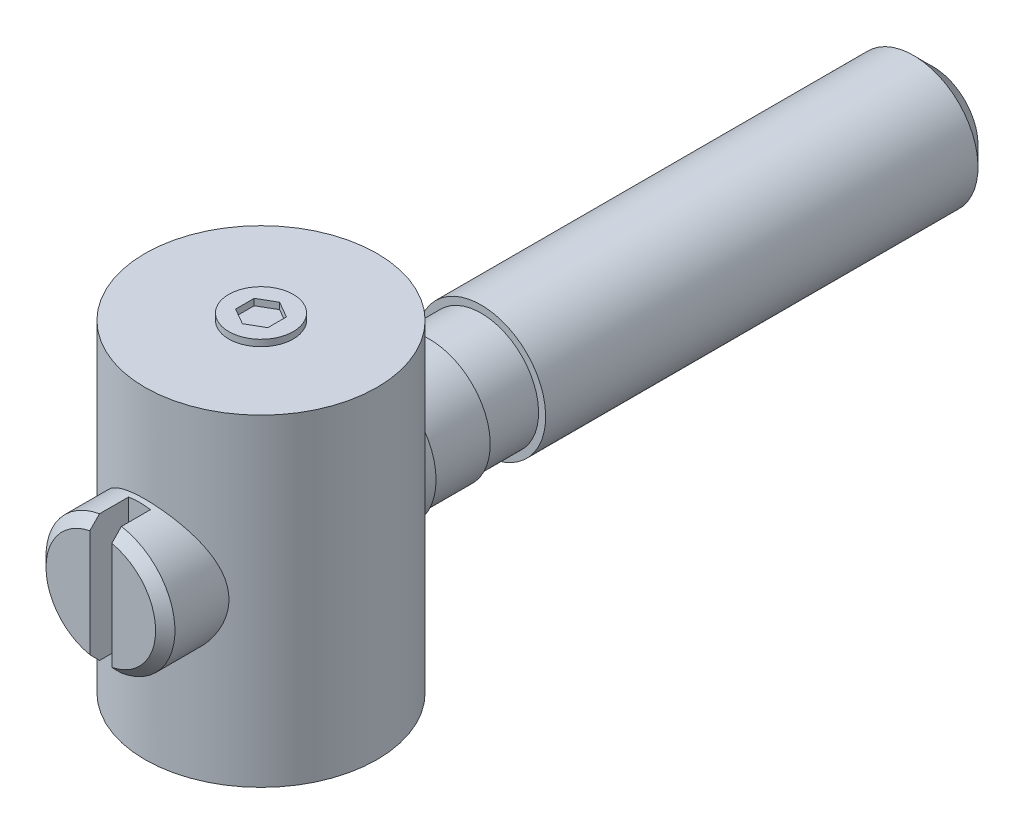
ISO-10303-21;
HEADER;
FILE_DESCRIPTION(('STEP AP214'),'2;1');
FILE_NAME('part.step','',(''),(''),'','','');
FILE_SCHEMA(('AUTOMOTIVE_DESIGN { 1 0 10303 214 1 1 1 1 }'));
ENDSEC;
DATA;
#1=APPLICATION_CONTEXT('core data for automotive mechanical design processes');
#2=APPLICATION_PROTOCOL_DEFINITION('international standard','automotive_design',2000,#1);
#3=PRODUCT_CONTEXT('',#1,'mechanical');
#4=PRODUCT('Part','Part','',(#3));
#5=PRODUCT_RELATED_PRODUCT_CATEGORY('part','',(#4));
#6=PRODUCT_DEFINITION_FORMATION('','',#4);
#7=PRODUCT_DEFINITION_CONTEXT('part definition',#1,'design');
#8=PRODUCT_DEFINITION('design','',#6,#7);
#9=PRODUCT_DEFINITION_SHAPE('','',#8);
#10=(LENGTH_UNIT() NAMED_UNIT(*) SI_UNIT(.MILLI.,.METRE.));
#11=(NAMED_UNIT(*) PLANE_ANGLE_UNIT() SI_UNIT($,.RADIAN.));
#12=(NAMED_UNIT(*) SI_UNIT($,.STERADIAN.) SOLID_ANGLE_UNIT());
#13=UNCERTAINTY_MEASURE_WITH_UNIT(LENGTH_MEASURE(1.E-05),#10,'distance_accuracy_value','');
#14=(GEOMETRIC_REPRESENTATION_CONTEXT(3) GLOBAL_UNCERTAINTY_ASSIGNED_CONTEXT((#13)) GLOBAL_UNIT_ASSIGNED_CONTEXT((#10,
#11,#12)) REPRESENTATION_CONTEXT('',''));
#15=CARTESIAN_POINT('',(0.,0.,0.));
#16=DIRECTION('',(0.,0.,1.));
#17=DIRECTION('',(1.,0.,0.));
#18=AXIS2_PLACEMENT_3D('',#15,#16,#17);
#19=CARTESIAN_POINT('',(0.,0.,12.4245));
#20=DIRECTION('',(0.,0.,-1.));
#21=DIRECTION('',(0.,1.,0.));
#22=AXIS2_PLACEMENT_3D('',#19,#20,#21);
#23=PLANE('',#22);
#24=CARTESIAN_POINT('',(0.,0.,12.4245));
#25=DIRECTION('',(0.,0.,-1.));
#26=DIRECTION('',(0.,1.,0.));
#27=AXIS2_PLACEMENT_3D('',#24,#25,#26);
#28=CIRCLE('',#27,4.25);
#29=CARTESIAN_POINT('',(0.85,-4.1641325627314,12.4245));
#30=VERTEX_POINT('',#29);
#31=CARTESIAN_POINT('',(0.85,4.1641325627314,12.4245));
#32=VERTEX_POINT('',#31);
#33=EDGE_CURVE('E175',#30,#32,#28,.F.);
#34=ORIENTED_EDGE('',*,*,#33,.T.);
#35=DIRECTION('',(0.,1.,0.));
#36=VECTOR('',#35,1.);
#37=CARTESIAN_POINT('',(0.85,4.92722031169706,12.4245));
#38=LINE('',#37,#36);
#39=EDGE_CURVE('E353',#30,#32,#38,.T.);
#40=ORIENTED_EDGE('',*,*,#39,.F.);
#41=EDGE_LOOP('',(#34,#40));
#42=FACE_BOUND('',#41,.T.);
#43=ADVANCED_FACE('F14',(#42),#23,.F.);
#44=CARTESIAN_POINT('',(-0.85,4.1641325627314,12.4245));
#45=VERTEX_POINT('',#44);
#46=CARTESIAN_POINT('',(-0.85,-4.1641325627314,12.4245));
#47=VERTEX_POINT('',#46);
#48=EDGE_CURVE('E176',#45,#47,#28,.F.);
#49=ORIENTED_EDGE('',*,*,#48,.T.);
#50=DIRECTION('',(0.,-1.,0.));
#51=VECTOR('',#50,1.);
#52=CARTESIAN_POINT('',(-0.85,4.92722031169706,12.4245));
#53=LINE('',#52,#51);
#54=EDGE_CURVE('E408',#45,#47,#53,.T.);
#55=ORIENTED_EDGE('',*,*,#54,.F.);
#56=EDGE_LOOP('',(#49,#55));
#57=FACE_BOUND('',#56,.T.);
#58=ADVANCED_FACE('F213',(#57),#23,.F.);
#59=CARTESIAN_POINT('',(0.,0.,12.4245));
#60=DIRECTION('',(0.,0.,-1.));
#61=DIRECTION('',(0.,1.,0.));
#62=AXIS2_PLACEMENT_3D('',#59,#60,#61);
#63=CONICAL_SURFACE('',#62,4.25,0.785398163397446);
#64=CARTESIAN_POINT('',(0.85,-10.8571842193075,5.78409370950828));
#65=CARTESIAN_POINT('',(0.850000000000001,-10.471658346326,6.16843314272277));
#66=CARTESIAN_POINT('',(0.850000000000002,-10.0860798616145,6.55271985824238));
#67=CARTESIAN_POINT('',(0.850000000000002,-9.31472993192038,7.32113134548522));
#68=CARTESIAN_POINT('',(0.850000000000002,-8.92895847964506,7.70525610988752));
#69=CARTESIAN_POINT('',(0.850000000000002,-8.15678249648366,8.47363775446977));
#70=CARTESIAN_POINT('',(0.850000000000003,-7.77037771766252,8.85789438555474));
#71=CARTESIAN_POINT('',(0.850000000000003,-6.99719715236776,9.62600327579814));
#72=CARTESIAN_POINT('',(0.850000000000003,-6.61042138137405,10.0098555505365));
#73=CARTESIAN_POINT('',(0.850000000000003,-5.8547904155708,10.7585441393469));
#74=CARTESIAN_POINT('',(0.850000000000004,-5.48596470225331,11.1234101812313));
#75=CARTESIAN_POINT('',(0.850000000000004,-4.9319304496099,11.6699477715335));
#76=CARTESIAN_POINT('',(0.850000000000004,-4.74710850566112,11.8520110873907));
#77=CARTESIAN_POINT('',(0.850000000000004,-4.37709943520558,12.2157621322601));
#78=CARTESIAN_POINT('',(0.850000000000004,-4.19191231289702,12.3974498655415));
#79=CARTESIAN_POINT('',(0.850000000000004,-3.82111814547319,12.7601731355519));
#80=CARTESIAN_POINT('',(0.850000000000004,-3.6355114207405,12.94120899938));
#81=CARTESIAN_POINT('',(0.850000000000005,-3.26347010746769,13.3024446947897));
#82=CARTESIAN_POINT('',(0.850000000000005,-3.07703548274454,13.4826444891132));
#83=CARTESIAN_POINT('',(0.850000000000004,-2.70287506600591,13.8416259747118));
#84=CARTESIAN_POINT('',(0.850000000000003,-2.51514955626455,14.0204079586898));
#85=CARTESIAN_POINT('',(0.850000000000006,-2.23171685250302,14.2866057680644));
#86=CARTESIAN_POINT('',(0.850000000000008,-2.13693525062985,14.3750060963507));
#87=CARTESIAN_POINT('',(0.850000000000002,-1.94648080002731,14.5508404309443));
#88=CARTESIAN_POINT('',(0.849999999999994,-1.85080797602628,14.6382744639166));
#89=CARTESIAN_POINT('',(0.850000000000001,-1.72767566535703,14.7490832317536));
#90=CARTESIAN_POINT('',(0.850000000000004,-1.70082923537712,14.7731393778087));
#91=CARTESIAN_POINT('',(0.850000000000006,-1.64701809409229,14.8211193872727));
#92=CARTESIAN_POINT('',(0.850000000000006,-1.62005338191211,14.8450432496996));
#93=CARTESIAN_POINT('',(0.850000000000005,-1.53895497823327,14.9165942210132));
#94=CARTESIAN_POINT('',(0.850000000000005,-1.48462201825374,14.9639962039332));
#95=CARTESIAN_POINT('',(0.850000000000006,-1.37483312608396,15.0583713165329));
#96=CARTESIAN_POINT('',(0.850000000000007,-1.31937170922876,15.1053380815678));
#97=CARTESIAN_POINT('',(0.850000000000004,-1.20752807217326,15.1981369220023));
#98=CARTESIAN_POINT('',(0.85,-1.15114610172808,15.2439692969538));
#99=CARTESIAN_POINT('',(0.85,-1.03663150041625,15.3344042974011));
#100=CARTESIAN_POINT('',(0.850000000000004,-0.978488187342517,15.3789934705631));
#101=CARTESIAN_POINT('',(0.850000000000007,-0.86030364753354,15.4657790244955));
#102=CARTESIAN_POINT('',(0.850000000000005,-0.800260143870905,15.5079723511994));
#103=CARTESIAN_POINT('',(0.850000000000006,-0.678046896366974,15.5881646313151));
#104=CARTESIAN_POINT('',(0.850000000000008,-0.615896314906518,15.6261924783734));
#105=CARTESIAN_POINT('',(0.850000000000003,-0.488100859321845,15.6957876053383));
#106=CARTESIAN_POINT('',(0.849999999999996,-0.422466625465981,15.7273732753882));
#107=CARTESIAN_POINT('',(0.850000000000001,-0.329088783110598,15.763320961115));
#108=CARTESIAN_POINT('',(0.850000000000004,-0.303167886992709,15.7723966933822));
#109=CARTESIAN_POINT('',(0.850000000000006,-0.250726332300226,15.7886439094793));
#110=CARTESIAN_POINT('',(0.850000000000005,-0.224205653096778,15.795815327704));
#111=CARTESIAN_POINT('',(0.850000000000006,-0.170756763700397,15.8079066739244));
#112=CARTESIAN_POINT('',(0.850000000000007,-0.143830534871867,15.8128352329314));
#113=CARTESIAN_POINT('',(0.850000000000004,-0.089641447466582,15.820207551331));
#114=CARTESIAN_POINT('',(0.85,-0.0623786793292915,15.822651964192));
#115=CARTESIAN_POINT('',(0.85,-0.00753726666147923,15.824910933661));
#116=CARTESIAN_POINT('',(0.850000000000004,0.0200422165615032,15.82470572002));
#117=CARTESIAN_POINT('',(0.850000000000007,0.0750465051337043,15.821636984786));
#118=CARTESIAN_POINT('',(0.850000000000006,0.102471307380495,15.8187734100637));
#119=CARTESIAN_POINT('',(0.850000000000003,0.184310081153,15.8064148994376));
#120=CARTESIAN_POINT('',(0.85,0.238169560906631,15.7931483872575));
#121=CARTESIAN_POINT('',(0.85,0.341986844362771,15.7595828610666));
#122=CARTESIAN_POINT('',(0.850000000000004,0.392008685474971,15.7394689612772));
#123=CARTESIAN_POINT('',(0.850000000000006,0.489870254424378,15.6944042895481));
#124=CARTESIAN_POINT('',(0.850000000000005,0.537706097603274,15.6694452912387));
#125=CARTESIAN_POINT('',(0.850000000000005,0.631894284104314,15.616071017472));
#126=CARTESIAN_POINT('',(0.850000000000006,0.67823108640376,15.5876288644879));
#127=CARTESIAN_POINT('',(0.850000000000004,0.769393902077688,15.5285213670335));
#128=CARTESIAN_POINT('',(0.85,0.814221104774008,15.4978578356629));
#129=CARTESIAN_POINT('',(0.85,0.906418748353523,15.4323418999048));
#130=CARTESIAN_POINT('',(0.850000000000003,0.953691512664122,15.3973530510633));
#131=CARTESIAN_POINT('',(0.850000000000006,1.04723694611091,15.3260585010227));
#132=CARTESIAN_POINT('',(0.850000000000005,1.09350947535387,15.2897526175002));
#133=CARTESIAN_POINT('',(0.850000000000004,1.23123275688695,15.1793793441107));
#134=CARTESIAN_POINT('',(0.850000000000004,1.32154148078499,15.1038914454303));
#135=CARTESIAN_POINT('',(0.850000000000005,1.50045598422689,14.9506177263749));
#136=CARTESIAN_POINT('',(0.850000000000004,1.58905825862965,14.8728278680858));
#137=CARTESIAN_POINT('',(0.850000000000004,1.76500186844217,14.7158903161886));
#138=CARTESIAN_POINT('',(0.850000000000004,1.85234357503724,14.6367430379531));
#139=CARTESIAN_POINT('',(0.850000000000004,2.0259304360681,14.4777547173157));
#140=CARTESIAN_POINT('',(0.850000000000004,2.11217801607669,14.3979163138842));
#141=CARTESIAN_POINT('',(0.850000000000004,2.28407604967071,14.2375871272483));
#142=CARTESIAN_POINT('',(0.850000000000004,2.36972645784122,14.1570962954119));
#143=CARTESIAN_POINT('',(0.850000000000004,2.54048363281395,13.9957355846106));
#144=CARTESIAN_POINT('',(0.850000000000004,2.62559090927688,13.9148662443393));
#145=CARTESIAN_POINT('',(0.850000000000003,2.79546438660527,13.7527747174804));
#146=CARTESIAN_POINT('',(0.850000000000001,2.8802305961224,13.6715525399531));
#147=CARTESIAN_POINT('',(0.849999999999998,3.1320378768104,13.4295009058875));
#148=CARTESIAN_POINT('',(0.850000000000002,3.29870204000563,13.2682794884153));
#149=CARTESIAN_POINT('',(0.850000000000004,3.63138320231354,12.9451699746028));
#150=CARTESIAN_POINT('',(0.850000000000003,3.79740019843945,12.7832818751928));
#151=CARTESIAN_POINT('',(0.850000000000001,4.29480941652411,12.2969477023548));
#152=CARTESIAN_POINT('',(0.850000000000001,4.62555293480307,11.9718384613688));
#153=CARTESIAN_POINT('',(0.850000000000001,5.28633819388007,11.3205425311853));
#154=CARTESIAN_POINT('',(0.850000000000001,5.61637944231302,10.994355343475));
#155=CARTESIAN_POINT('',(0.85,6.275926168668,10.3414463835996));
#156=CARTESIAN_POINT('',(0.85,6.60543165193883,10.0147246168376));
#157=CARTESIAN_POINT('',(0.849999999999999,7.26217149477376,9.36286110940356));
#158=CARTESIAN_POINT('',(0.849999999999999,7.58940782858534,9.03772135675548));
#159=CARTESIAN_POINT('',(0.849999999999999,8.24365487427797,8.38721275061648));
#160=CARTESIAN_POINT('',(0.849999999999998,8.5706655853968,8.06184389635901));
#161=CARTESIAN_POINT('',(0.849999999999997,9.22432804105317,7.41114429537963));
#162=CARTESIAN_POINT('',(0.849999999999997,9.5509798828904,7.08581364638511));
#163=CARTESIAN_POINT('',(0.849999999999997,10.2041625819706,6.43503329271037));
#164=CARTESIAN_POINT('',(0.849999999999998,10.5306934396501,6.10958358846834));
#165=CARTESIAN_POINT('',(0.85,10.8571842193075,5.78409370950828));
#166=B_SPLINE_CURVE_WITH_KNOTS('',3,(#64,#65,#66,#67,#68,#69,#70,#71,#72,#73,#74,#75,#76,#77,
#78,#79,#80,#81,#82,#83,#84,#85,#86,#87,#88,#89,#90,#91,#92,#93,#94,#95,#96,#97,#98,#99,#100,
#101,#102,#103,#104,#105,#106,#107,#108,#109,#110,#111,#112,#113,#114,#115,#116,#117,#118,#119,
#120,#121,#122,#123,#124,#125,#126,#127,#128,#129,#130,#131,#132,#133,#134,#135,#136,#137,#138,
#139,#140,#141,#142,#143,#144,#145,#146,#147,#148,#149,#150,#151,#152,#153,#154,#155,#156,#157,
#158,#159,#160,#161,#162,#163,#164,#165),.UNSPECIFIED.,.F.,.F.,(4,2,2,2,2,2,2,2,2,2,2,2,2,2,2,2,
2,2,2,2,2,2,2,2,2,2,2,2,2,2,2,2,2,2,2,2,2,2,2,2,2,2,2,2,2,2,2,2,2,2,4),(0.,1.6331329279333,
3.26633311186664,4.90115899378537,6.5359193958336,8.09233592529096,8.87063870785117,
9.6489325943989,10.4267573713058,11.2046164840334,11.9823105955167,12.3711302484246,
12.7599391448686,12.8680815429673,12.9762247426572,13.192531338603,13.4105501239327,
13.6285107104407,13.8482899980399,14.06834343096,14.2867582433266,14.5045405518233,
14.5868729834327,14.6692082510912,14.7512239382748,14.8332180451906,14.9158243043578,
14.9984322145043,15.1639989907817,15.3254048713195,15.4870872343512,15.6501067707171,
15.8129947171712,15.9894007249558,16.1658312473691,16.5188698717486,16.8725695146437,
17.2261627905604,17.5787425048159,17.9313487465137,18.2835517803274,18.6357458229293,
19.3313885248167,20.0270344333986,21.4183551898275,22.810449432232,24.2025296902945,
25.586435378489,26.970345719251,28.3534122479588,29.7364737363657),.UNSPECIFIED.);
#167=CARTESIAN_POINT('',(0.85,-4.92722031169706,11.6745));
#168=VERTEX_POINT('',#167);
#169=EDGE_CURVE('E191',#168,#30,#166,.T.);
#170=ORIENTED_EDGE('',*,*,#169,.F.);
#171=CARTESIAN_POINT('',(0.,0.,11.6745));
#172=DIRECTION('',(0.,0.,-1.));
#173=DIRECTION('',(0.,1.,0.));
#174=AXIS2_PLACEMENT_3D('',#171,#172,#173);
#175=CIRCLE('',#174,5.);
#176=CARTESIAN_POINT('',(0.85,4.92722031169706,11.6745));
#177=VERTEX_POINT('',#176);
#178=EDGE_CURVE('E180',#177,#168,#175,.T.);
#179=ORIENTED_EDGE('',*,*,#178,.F.);
#180=EDGE_CURVE('E183',#32,#177,#166,.T.);
#181=ORIENTED_EDGE('',*,*,#180,.F.);
#182=ORIENTED_EDGE('',*,*,#33,.F.);
#183=EDGE_LOOP('',(#170,#179,#181,#182));
#184=FACE_BOUND('',#183,.T.);
#185=ADVANCED_FACE('F199',(#184),#63,.T.);
#186=CARTESIAN_POINT('',(0.85,4.92722031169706,9.4245));
#187=DIRECTION('',(1.,0.,0.));
#188=DIRECTION('',(0.,1.,0.));
#189=AXIS2_PLACEMENT_3D('',#186,#187,#188);
#190=PLANE('',#189);
#191=ORIENTED_EDGE('',*,*,#169,.T.);
#192=ORIENTED_EDGE('',*,*,#39,.T.);
#193=ORIENTED_EDGE('',*,*,#180,.T.);
#194=DIRECTION('',(0.,0.,1.));
#195=VECTOR('',#194,1.);
#196=CARTESIAN_POINT('',(0.85,4.92722031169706,9.4245));
#197=LINE('',#196,#195);
#198=CARTESIAN_POINT('',(0.85,4.92722031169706,9.4245));
#199=VERTEX_POINT('',#198);
#200=EDGE_CURVE('E424',#199,#177,#197,.T.);
#201=ORIENTED_EDGE('',*,*,#200,.F.);
#202=DIRECTION('',(0.,1.,0.));
#203=VECTOR('',#202,1.);
#204=CARTESIAN_POINT('',(0.85,4.92722031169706,9.4245));
#205=LINE('',#204,#203);
#206=CARTESIAN_POINT('',(0.85,-4.92722031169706,9.4245));
#207=VERTEX_POINT('',#206);
#208=EDGE_CURVE('E87',#207,#199,#205,.T.);
#209=ORIENTED_EDGE('',*,*,#208,.F.);
#210=DIRECTION('',(0.,0.,1.));
#211=VECTOR('',#210,1.);
#212=CARTESIAN_POINT('',(0.85,-4.92722031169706,9.4245));
#213=LINE('',#212,#211);
#214=EDGE_CURVE('E426',#207,#168,#213,.T.);
#215=ORIENTED_EDGE('',*,*,#214,.T.);
#216=EDGE_LOOP('',(#191,#192,#193,#201,#209,#215));
#217=FACE_BOUND('',#216,.T.);
#218=ADVANCED_FACE('F203',(#217),#190,.F.);
#219=CARTESIAN_POINT('',(0.,0.,9.4245));
#220=DIRECTION('',(0.,0.,1.));
#221=DIRECTION('',(0.,-1.,0.));
#222=AXIS2_PLACEMENT_3D('',#219,#220,#221);
#223=PLANE('',#222);
#224=CARTESIAN_POINT('',(0.,0.,9.4245));
#225=DIRECTION('',(0.,0.,1.));
#226=DIRECTION('',(0.,-1.,0.));
#227=AXIS2_PLACEMENT_3D('',#224,#225,#226);
#228=CIRCLE('',#227,5.);
#229=CARTESIAN_POINT('',(-0.85,-4.92722031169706,9.4245));
#230=VERTEX_POINT('',#229);
#231=EDGE_CURVE('E412',#230,#207,#228,.T.);
#232=ORIENTED_EDGE('',*,*,#231,.T.);
#233=ORIENTED_EDGE('',*,*,#208,.T.);
#234=CARTESIAN_POINT('',(0.,0.,9.4245));
#235=DIRECTION('',(0.,0.,1.));
#236=DIRECTION('',(0.,-1.,0.));
#237=AXIS2_PLACEMENT_3D('',#234,#235,#236);
#238=CIRCLE('',#237,5.);
#239=CARTESIAN_POINT('',(-0.85,4.92722031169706,9.4245));
#240=VERTEX_POINT('',#239);
#241=EDGE_CURVE('E430',#199,#240,#238,.T.);
#242=ORIENTED_EDGE('',*,*,#241,.T.);
#243=DIRECTION('',(0.,-1.,0.));
#244=VECTOR('',#243,1.);
#245=CARTESIAN_POINT('',(-0.85,4.92722031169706,9.4245));
#246=LINE('',#245,#244);
#247=EDGE_CURVE('E415',#240,#230,#246,.T.);
#248=ORIENTED_EDGE('',*,*,#247,.T.);
#249=EDGE_LOOP('',(#232,#233,#242,#248));
#250=FACE_BOUND('',#249,.T.);
#251=ADVANCED_FACE('F207',(#250),#223,.T.);
#252=CARTESIAN_POINT('',(-0.85,4.92722031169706,9.4245));
#253=DIRECTION('',(-1.,0.,0.));
#254=DIRECTION('',(0.,-1.,0.));
#255=AXIS2_PLACEMENT_3D('',#252,#253,#254);
#256=PLANE('',#255);
#257=CARTESIAN_POINT('',(-0.85,10.8571842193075,5.78409370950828));
#258=CARTESIAN_POINT('',(-0.850000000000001,10.471658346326,6.16843314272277));
#259=CARTESIAN_POINT('',(-0.850000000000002,10.0860798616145,6.55271985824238));
#260=CARTESIAN_POINT('',(-0.850000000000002,9.31472993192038,7.32113134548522));
#261=CARTESIAN_POINT('',(-0.850000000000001,8.92895847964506,7.70525610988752));
#262=CARTESIAN_POINT('',(-0.850000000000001,8.15678249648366,8.47363775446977));
#263=CARTESIAN_POINT('',(-0.85,7.77037771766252,8.85789438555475));
#264=CARTESIAN_POINT('',(-0.85,6.99719715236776,9.62600327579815));
#265=CARTESIAN_POINT('',(-0.85,6.61042138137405,10.0098555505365));
#266=CARTESIAN_POINT('',(-0.849999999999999,5.8547904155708,10.7585441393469));
#267=CARTESIAN_POINT('',(-0.849999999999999,5.48596470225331,11.1234101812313));
#268=CARTESIAN_POINT('',(-0.849999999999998,4.9319304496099,11.6699477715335));
#269=CARTESIAN_POINT('',(-0.849999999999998,4.74710850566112,11.8520110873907));
#270=CARTESIAN_POINT('',(-0.849999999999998,4.37709943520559,12.2157621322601));
#271=CARTESIAN_POINT('',(-0.849999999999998,4.19191231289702,12.3974498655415));
#272=CARTESIAN_POINT('',(-0.849999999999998,3.8211181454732,12.7601731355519));
#273=CARTESIAN_POINT('',(-0.849999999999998,3.6355114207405,12.94120899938));
#274=CARTESIAN_POINT('',(-0.849999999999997,3.2634701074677,13.3024446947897));
#275=CARTESIAN_POINT('',(-0.849999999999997,3.07703548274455,13.4826444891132));
#276=CARTESIAN_POINT('',(-0.849999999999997,2.70287506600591,13.8416259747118));
#277=CARTESIAN_POINT('',(-0.849999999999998,2.51514955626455,14.0204079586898));
#278=CARTESIAN_POINT('',(-0.849999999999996,2.23171685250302,14.2866057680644));
#279=CARTESIAN_POINT('',(-0.849999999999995,2.13693525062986,14.3750060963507));
#280=CARTESIAN_POINT('',(-0.849999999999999,1.94648080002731,14.5508404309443));
#281=CARTESIAN_POINT('',(-0.850000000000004,1.85080797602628,14.6382744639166));
#282=CARTESIAN_POINT('',(-0.849999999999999,1.72767566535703,14.7490832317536));
#283=CARTESIAN_POINT('',(-0.849999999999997,1.70082923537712,14.7731393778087));
#284=CARTESIAN_POINT('',(-0.849999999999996,1.64701809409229,14.8211193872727));
#285=CARTESIAN_POINT('',(-0.849999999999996,1.62005338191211,14.8450432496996));
#286=CARTESIAN_POINT('',(-0.849999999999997,1.53895497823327,14.9165942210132));
#287=CARTESIAN_POINT('',(-0.849999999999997,1.48462201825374,14.9639962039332));
#288=CARTESIAN_POINT('',(-0.849999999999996,1.37483312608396,15.0583713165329));
#289=CARTESIAN_POINT('',(-0.849999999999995,1.31937170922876,15.1053380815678));
#290=CARTESIAN_POINT('',(-0.849999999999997,1.20752807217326,15.1981369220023));
#291=CARTESIAN_POINT('',(-0.85,1.15114610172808,15.2439692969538));
#292=CARTESIAN_POINT('',(-0.85,1.03663150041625,15.3344042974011));
#293=CARTESIAN_POINT('',(-0.849999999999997,0.978488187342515,15.3789934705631));
#294=CARTESIAN_POINT('',(-0.849999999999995,0.860303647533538,15.4657790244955));
#295=CARTESIAN_POINT('',(-0.849999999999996,0.800260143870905,15.5079723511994));
#296=CARTESIAN_POINT('',(-0.849999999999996,0.678046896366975,15.5881646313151));
#297=CARTESIAN_POINT('',(-0.849999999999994,0.61589631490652,15.6261924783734));
#298=CARTESIAN_POINT('',(-0.849999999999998,0.488100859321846,15.6957876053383));
#299=CARTESIAN_POINT('',(-0.850000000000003,0.422466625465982,15.7273732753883));
#300=CARTESIAN_POINT('',(-0.849999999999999,0.329088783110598,15.763320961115));
#301=CARTESIAN_POINT('',(-0.849999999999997,0.303167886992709,15.7723966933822));
#302=CARTESIAN_POINT('',(-0.849999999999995,0.250726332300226,15.7886439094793));
#303=CARTESIAN_POINT('',(-0.849999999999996,0.224205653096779,15.795815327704));
#304=CARTESIAN_POINT('',(-0.849999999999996,0.170756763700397,15.8079066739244));
#305=CARTESIAN_POINT('',(-0.849999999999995,0.143830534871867,15.8128352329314));
#306=CARTESIAN_POINT('',(-0.849999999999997,0.0896414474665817,15.820207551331));
#307=CARTESIAN_POINT('',(-0.85,0.0623786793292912,15.822651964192));
#308=CARTESIAN_POINT('',(-0.85,0.00753726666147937,15.824910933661));
#309=CARTESIAN_POINT('',(-0.849999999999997,-0.0200422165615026,15.82470572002));
#310=CARTESIAN_POINT('',(-0.849999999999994,-0.0750465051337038,15.821636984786));
#311=CARTESIAN_POINT('',(-0.849999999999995,-0.102471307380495,15.8187734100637));
#312=CARTESIAN_POINT('',(-0.849999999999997,-0.184310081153,15.8064148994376));
#313=CARTESIAN_POINT('',(-0.85,-0.238169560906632,15.7931483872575));
#314=CARTESIAN_POINT('',(-0.85,-0.341986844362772,15.7595828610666));
#315=CARTESIAN_POINT('',(-0.849999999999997,-0.392008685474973,15.7394689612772));
#316=CARTESIAN_POINT('',(-0.849999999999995,-0.48987025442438,15.6944042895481));
#317=CARTESIAN_POINT('',(-0.849999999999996,-0.537706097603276,15.6694452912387));
#318=CARTESIAN_POINT('',(-0.849999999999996,-0.631894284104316,15.616071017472));
#319=CARTESIAN_POINT('',(-0.849999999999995,-0.678231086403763,15.5876288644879));
#320=CARTESIAN_POINT('',(-0.849999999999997,-0.76939390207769,15.5285213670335));
#321=CARTESIAN_POINT('',(-0.85,-0.81422110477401,15.4978578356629));
#322=CARTESIAN_POINT('',(-0.85,-0.906418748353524,15.4323418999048));
#323=CARTESIAN_POINT('',(-0.849999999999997,-0.953691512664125,15.3973530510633));
#324=CARTESIAN_POINT('',(-0.849999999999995,-1.04723694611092,15.3260585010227));
#325=CARTESIAN_POINT('',(-0.849999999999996,-1.09350947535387,15.2897526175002));
#326=CARTESIAN_POINT('',(-0.849999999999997,-1.23123275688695,15.1793793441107));
#327=CARTESIAN_POINT('',(-0.849999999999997,-1.32154148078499,15.1038914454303));
#328=CARTESIAN_POINT('',(-0.849999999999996,-1.50045598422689,14.9506177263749));
#329=CARTESIAN_POINT('',(-0.849999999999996,-1.58905825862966,14.8728278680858));
#330=CARTESIAN_POINT('',(-0.849999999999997,-1.76500186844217,14.7158903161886));
#331=CARTESIAN_POINT('',(-0.849999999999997,-1.85234357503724,14.6367430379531));
#332=CARTESIAN_POINT('',(-0.849999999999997,-2.0259304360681,14.4777547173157));
#333=CARTESIAN_POINT('',(-0.849999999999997,-2.1121780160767,14.3979163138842));
#334=CARTESIAN_POINT('',(-0.849999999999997,-2.28407604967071,14.2375871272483));
#335=CARTESIAN_POINT('',(-0.849999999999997,-2.36972645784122,14.1570962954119));
#336=CARTESIAN_POINT('',(-0.849999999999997,-2.54048363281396,13.9957355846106));
#337=CARTESIAN_POINT('',(-0.849999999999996,-2.62559090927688,13.9148662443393));
#338=CARTESIAN_POINT('',(-0.849999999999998,-2.79546438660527,13.7527747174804));
#339=CARTESIAN_POINT('',(-0.849999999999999,-2.8802305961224,13.6715525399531));
#340=CARTESIAN_POINT('',(-0.850000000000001,-3.1320378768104,13.4295009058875));
#341=CARTESIAN_POINT('',(-0.849999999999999,-3.29870204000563,13.2682794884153));
#342=CARTESIAN_POINT('',(-0.849999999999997,-3.63138320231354,12.9451699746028));
#343=CARTESIAN_POINT('',(-0.849999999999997,-3.79740019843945,12.7832818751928));
#344=CARTESIAN_POINT('',(-0.849999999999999,-4.29480941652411,12.2969477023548));
#345=CARTESIAN_POINT('',(-0.849999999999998,-4.62555293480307,11.9718384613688));
#346=CARTESIAN_POINT('',(-0.849999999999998,-5.28633819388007,11.3205425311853));
#347=CARTESIAN_POINT('',(-0.849999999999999,-5.61637944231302,10.994355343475));
#348=CARTESIAN_POINT('',(-0.849999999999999,-6.275926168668,10.3414463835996));
#349=CARTESIAN_POINT('',(-0.85,-6.60543165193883,10.0147246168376));
#350=CARTESIAN_POINT('',(-0.85,-7.26217149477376,9.36286110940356));
#351=CARTESIAN_POINT('',(-0.85,-7.58940782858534,9.03772135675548));
#352=CARTESIAN_POINT('',(-0.850000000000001,-8.24365487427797,8.38721275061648));
#353=CARTESIAN_POINT('',(-0.850000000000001,-8.5706655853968,8.06184389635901));
#354=CARTESIAN_POINT('',(-0.850000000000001,-9.22432804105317,7.41114429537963));
#355=CARTESIAN_POINT('',(-0.850000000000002,-9.55097988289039,7.08581364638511));
#356=CARTESIAN_POINT('',(-0.850000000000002,-10.2041625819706,6.43503329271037));
#357=CARTESIAN_POINT('',(-0.850000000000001,-10.53069343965,6.10958358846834));
#358=CARTESIAN_POINT('',(-0.85,-10.8571842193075,5.78409370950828));
#359=B_SPLINE_CURVE_WITH_KNOTS('',3,(#257,#258,#259,#260,#261,#262,#263,#264,#265,#266,#267,
#268,#269,#270,#271,#272,#273,#274,#275,#276,#277,#278,#279,#280,#281,#282,#283,#284,#285,#286,
#287,#288,#289,#290,#291,#292,#293,#294,#295,#296,#297,#298,#299,#300,#301,#302,#303,#304,#305,
#306,#307,#308,#309,#310,#311,#312,#313,#314,#315,#316,#317,#318,#319,#320,#321,#322,#323,#324,
#325,#326,#327,#328,#329,#330,#331,#332,#333,#334,#335,#336,#337,#338,#339,#340,#341,#342,#343,
#344,#345,#346,#347,#348,#349,#350,#351,#352,#353,#354,#355,#356,#357,#358),.UNSPECIFIED.,.F.,
.F.,(4,2,2,2,2,2,2,2,2,2,2,2,2,2,2,2,2,2,2,2,2,2,2,2,2,2,2,2,2,2,2,2,2,2,2,2,2,2,2,2,2,2,2,2,2,
2,2,2,2,2,4),(0.,1.6331329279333,3.26633311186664,4.90115899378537,6.5359193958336,
8.09233592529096,8.87063870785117,9.64893259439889,10.4267573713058,11.2046164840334,
11.9823105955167,12.3711302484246,12.7599391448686,12.8680815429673,12.9762247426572,
13.192531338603,13.4105501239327,13.6285107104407,13.8482899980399,14.06834343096,
14.2867582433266,14.5045405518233,14.5868729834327,14.6692082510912,14.7512239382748,
14.8332180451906,14.9158243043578,14.9984322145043,15.1639989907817,15.3254048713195,
15.4870872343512,15.6501067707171,15.8129947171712,15.9894007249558,16.1658312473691,
16.5188698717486,16.8725695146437,17.2261627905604,17.5787425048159,17.9313487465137,
18.2835517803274,18.6357458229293,19.3313885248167,20.0270344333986,21.4183551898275,
22.810449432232,24.2025296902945,25.586435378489,26.970345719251,28.3534122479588,
29.7364737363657),.UNSPECIFIED.);
#360=CARTESIAN_POINT('',(-0.85,4.92722031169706,11.6745));
#361=VERTEX_POINT('',#360);
#362=EDGE_CURVE('E443',#361,#45,#359,.T.);
#363=ORIENTED_EDGE('',*,*,#362,.T.);
#364=ORIENTED_EDGE('',*,*,#54,.T.);
#365=CARTESIAN_POINT('',(-0.85,-4.92722031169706,11.6745));
#366=VERTEX_POINT('',#365);
#367=EDGE_CURVE('E192',#47,#366,#359,.T.);
#368=ORIENTED_EDGE('',*,*,#367,.T.);
#369=DIRECTION('',(0.,0.,1.));
#370=VECTOR('',#369,1.);
#371=CARTESIAN_POINT('',(-0.85,-4.92722031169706,9.4245));
#372=LINE('',#371,#370);
#373=EDGE_CURVE('E418',#230,#366,#372,.T.);
#374=ORIENTED_EDGE('',*,*,#373,.F.);
#375=ORIENTED_EDGE('',*,*,#247,.F.);
#376=DIRECTION('',(0.,0.,1.));
#377=VECTOR('',#376,1.);
#378=CARTESIAN_POINT('',(-0.85,4.92722031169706,9.4245));
#379=LINE('',#378,#377);
#380=EDGE_CURVE('E422',#240,#361,#379,.T.);
#381=ORIENTED_EDGE('',*,*,#380,.T.);
#382=EDGE_LOOP('',(#363,#364,#368,#374,#375,#381));
#383=FACE_BOUND('',#382,.T.);
#384=ADVANCED_FACE('F208',(#383),#256,.F.);
#385=ORIENTED_EDGE('',*,*,#362,.F.);
#386=EDGE_CURVE('E179',#366,#361,#175,.T.);
#387=ORIENTED_EDGE('',*,*,#386,.F.);
#388=ORIENTED_EDGE('',*,*,#367,.F.);
#389=ORIENTED_EDGE('',*,*,#48,.F.);
#390=EDGE_LOOP('',(#385,#387,#388,#389));
#391=FACE_BOUND('',#390,.T.);
#392=ADVANCED_FACE('F301',(#391),#63,.T.);
#393=CARTESIAN_POINT('',(0.,0.,42.719865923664));
#394=DIRECTION('',(0.,0.,1.));
#395=DIRECTION('',(0.,-1.,0.));
#396=AXIS2_PLACEMENT_3D('',#393,#394,#395);
#397=CYLINDRICAL_SURFACE('',#396,5.);
#398=ORIENTED_EDGE('',*,*,#386,.T.);
#399=ORIENTED_EDGE('',*,*,#380,.F.);
#400=ORIENTED_EDGE('',*,*,#241,.F.);
#401=ORIENTED_EDGE('',*,*,#200,.T.);
#402=ORIENTED_EDGE('',*,*,#178,.T.);
#403=ORIENTED_EDGE('',*,*,#214,.F.);
#404=ORIENTED_EDGE('',*,*,#231,.F.);
#405=ORIENTED_EDGE('',*,*,#373,.T.);
#406=EDGE_LOOP('',(#398,#399,#400,#401,#402,#403,#404,#405));
#407=FACE_BOUND('',#406,.T.);
#408=CARTESIAN_POINT('',(0.,-5.,9.));
#409=CARTESIAN_POINT('',(-0.129728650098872,-5.00000040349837,9.00000035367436));
#410=CARTESIAN_POINT('',(-0.259452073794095,-4.99494572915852,8.99718916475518));
#411=CARTESIAN_POINT('',(-0.517921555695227,-4.9747929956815,8.98601661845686));
#412=CARTESIAN_POINT('',(-0.646667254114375,-4.95969140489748,8.97765330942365));
#413=CARTESIAN_POINT('',(-0.902114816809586,-4.91964430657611,8.955591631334));
#414=CARTESIAN_POINT('',(-1.02881719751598,-4.89470132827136,8.94189463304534));
#415=CARTESIAN_POINT('',(-1.27935747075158,-4.83526936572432,8.90950110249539));
#416=CARTESIAN_POINT('',(-1.40319416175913,-4.80077645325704,8.89080251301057));
#417=CARTESIAN_POINT('',(-1.64664425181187,-4.72279881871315,8.84894060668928));
#418=CARTESIAN_POINT('',(-1.76627303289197,-4.67935197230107,8.82579612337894));
#419=CARTESIAN_POINT('',(-2.00118015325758,-4.58381684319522,8.77551906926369));
#420=CARTESIAN_POINT('',(-2.1164568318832,-4.53172530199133,8.74838499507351));
#421=CARTESIAN_POINT('',(-2.45478877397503,-4.36318845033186,8.6618736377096));
#422=CARTESIAN_POINT('',(-2.67053417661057,-4.23441988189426,8.59735346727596));
#423=CARTESIAN_POINT('',(-3.09271229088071,-3.93780768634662,8.45507241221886));
#424=CARTESIAN_POINT('',(-3.29745415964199,-3.76786951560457,8.37670278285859));
#425=CARTESIAN_POINT('',(-3.67715998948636,-3.39835387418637,8.21711406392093));
#426=CARTESIAN_POINT('',(-3.85209353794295,-3.19874651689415,8.13589216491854));
#427=CARTESIAN_POINT('',(-4.18516795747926,-2.75130582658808,7.97009263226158));
#428=CARTESIAN_POINT('',(-4.33981028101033,-2.50063516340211,7.88600912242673));
#429=CARTESIAN_POINT('',(-4.53792036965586,-2.10454112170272,7.77258662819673));
#430=CARTESIAN_POINT('',(-4.59831134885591,-1.96917342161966,7.73689861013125));
#431=CARTESIAN_POINT('',(-4.70719976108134,-1.69244684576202,7.67113380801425));
#432=CARTESIAN_POINT('',(-4.75570081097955,-1.55108980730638,7.64105531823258));
#433=CARTESIAN_POINT('',(-4.86451848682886,-1.17999431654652,7.57250099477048));
#434=CARTESIAN_POINT('',(-4.9154532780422,-0.946409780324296,7.53922489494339));
#435=CARTESIAN_POINT('',(-4.98336969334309,-0.472499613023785,7.49451395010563));
#436=CARTESIAN_POINT('',(-5.00038478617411,-0.232180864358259,7.48305757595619));
#437=CARTESIAN_POINT('',(-4.99960164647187,0.248654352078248,7.48358103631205));
#438=CARTESIAN_POINT('',(-4.98176529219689,0.489170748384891,7.49558653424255));
#439=CARTESIAN_POINT('',(-4.91220969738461,0.963158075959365,7.54134329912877));
#440=CARTESIAN_POINT('',(-4.8604684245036,1.19662432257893,7.57510870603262));
#441=CARTESIAN_POINT('',(-4.725553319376,1.65086354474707,7.65998850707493));
#442=CARTESIAN_POINT('',(-4.64237249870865,1.87163368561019,7.71110675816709));
#443=CARTESIAN_POINT('',(-4.447403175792,2.29681665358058,7.82517266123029));
#444=CARTESIAN_POINT('',(-4.33560350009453,2.50122305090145,7.88812493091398));
#445=CARTESIAN_POINT('',(-4.06693738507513,2.92082028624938,8.03034742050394));
#446=CARTESIAN_POINT('',(-3.90580419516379,3.13292950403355,8.11064361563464));
#447=CARTESIAN_POINT('',(-3.55190169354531,3.52909892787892,8.2717439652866));
#448=CARTESIAN_POINT('',(-3.35910741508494,3.7131367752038,8.3525484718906));
#449=CARTESIAN_POINT('',(-3.0382033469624,3.97377961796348,8.47255594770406));
#450=CARTESIAN_POINT('',(-2.91988181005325,4.06153890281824,8.51415799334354));
#451=CARTESIAN_POINT('',(-2.67521853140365,4.22669686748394,8.59416899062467));
#452=CARTESIAN_POINT('',(-2.54887988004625,4.30409950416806,8.63257915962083));
#453=CARTESIAN_POINT('',(-2.28891079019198,4.44780208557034,8.70511911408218));
#454=CARTESIAN_POINT('',(-2.15528226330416,4.51410492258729,8.73925001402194));
#455=CARTESIAN_POINT('',(-1.88158110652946,4.63486956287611,8.8022360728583));
#456=CARTESIAN_POINT('',(-1.74150926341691,4.68933280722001,8.83109187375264));
#457=CARTESIAN_POINT('',(-1.46611496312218,4.78227003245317,8.88080389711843));
#458=CARTESIAN_POINT('',(-1.33115857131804,4.82160315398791,8.90208189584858));
#459=CARTESIAN_POINT('',(-1.05765459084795,4.88888456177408,8.9387020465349));
#460=CARTESIAN_POINT('',(-0.919107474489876,4.91683433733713,8.95404497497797));
#461=CARTESIAN_POINT('',(-0.639688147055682,4.96092635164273,8.97833234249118));
#462=CARTESIAN_POINT('',(-0.49881761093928,4.97707674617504,8.98728120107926));
#463=CARTESIAN_POINT('',(-0.215954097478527,4.99734561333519,8.99852157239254));
#464=CARTESIAN_POINT('',(-0.0739612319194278,5.00146526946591,9.00081373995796));
#465=CARTESIAN_POINT('',(0.193661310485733,4.99783122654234,8.99879540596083));
#466=CARTESIAN_POINT('',(0.319316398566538,4.99137388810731,8.99520578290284));
#467=CARTESIAN_POINT('',(0.569568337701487,4.96904196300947,8.98283315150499));
#468=CARTESIAN_POINT('',(0.694164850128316,4.9531644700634,8.97404854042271));
#469=CARTESIAN_POINT('',(0.941327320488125,4.91218729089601,8.95149651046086));
#470=CARTESIAN_POINT('',(1.06389401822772,4.88709104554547,8.93773095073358));
#471=CARTESIAN_POINT('',(1.30624674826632,4.82797111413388,8.90554320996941));
#472=CARTESIAN_POINT('',(1.42603168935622,4.7939439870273,8.88711923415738));
#473=CARTESIAN_POINT('',(1.77910695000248,4.67928639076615,8.82561614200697));
#474=CARTESIAN_POINT('',(2.00729552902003,4.58588050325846,8.77619255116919));
#475=CARTESIAN_POINT('',(2.44488800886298,4.36833983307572,8.66450874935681));
#476=CARTESIAN_POINT('',(2.65428686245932,4.24419682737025,8.6022451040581));
#477=CARTESIAN_POINT('',(3.07172957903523,3.95417802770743,8.46272453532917));
#478=CARTESIAN_POINT('',(3.27740782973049,3.7853191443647,8.38458363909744));
#479=CARTESIAN_POINT('',(3.65908152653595,3.41781320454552,8.22520611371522));
#480=CARTESIAN_POINT('',(3.83504389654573,3.21913341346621,8.14396615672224));
#481=CARTESIAN_POINT('',(4.17023823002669,2.7738769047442,7.97793731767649));
#482=CARTESIAN_POINT('',(4.32600004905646,2.52449151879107,7.89361512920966));
#483=CARTESIAN_POINT('',(4.59275891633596,1.99831062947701,7.74146523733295));
#484=CARTESIAN_POINT('',(4.70381927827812,1.7215545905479,7.67361425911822));
#485=CARTESIAN_POINT('',(4.85777774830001,1.20756607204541,7.57683809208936));
#486=CARTESIAN_POINT('',(4.91005771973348,0.97411746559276,7.5427474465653));
#487=CARTESIAN_POINT('',(4.98067851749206,0.500106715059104,7.49631291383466));
#488=CARTESIAN_POINT('',(4.99905324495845,0.259551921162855,7.48394730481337));
#489=CARTESIAN_POINT('',(5.00087641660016,-0.222043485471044,7.48272923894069));
#490=CARTESIAN_POINT('',(4.98428138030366,-0.463084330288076,7.49390605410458));
#491=CARTESIAN_POINT('',(4.91703272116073,-0.938336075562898,7.5381922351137));
#492=CARTESIAN_POINT('',(4.86635734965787,-1.17254251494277,7.57131560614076));
#493=CARTESIAN_POINT('',(4.73359019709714,-1.62763734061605,7.65501053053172));
#494=CARTESIAN_POINT('',(4.65159333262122,-1.84856365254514,7.70552932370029));
#495=CARTESIAN_POINT('',(4.45898685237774,-2.27421802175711,7.81855933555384));
#496=CARTESIAN_POINT('',(4.34836621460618,-2.47893979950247,7.88107517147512));
#497=CARTESIAN_POINT('',(4.08239378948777,-2.89911833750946,8.02246926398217));
#498=CARTESIAN_POINT('',(3.92281334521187,-3.11154387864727,8.10239358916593));
#499=CARTESIAN_POINT('',(3.57208449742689,-3.50861520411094,8.26301218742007));
#500=CARTESIAN_POINT('',(3.38091059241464,-3.69323831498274,8.34370703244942));
#501=CARTESIAN_POINT('',(3.06226198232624,-3.95526647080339,8.46388232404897));
#502=CARTESIAN_POINT('',(2.944544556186,-4.04369106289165,8.50565265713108));
#503=CARTESIAN_POINT('',(2.7010491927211,-4.21023353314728,8.58607842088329));
#504=CARTESIAN_POINT('',(2.5752743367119,-4.28835531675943,8.62473502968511));
#505=CARTESIAN_POINT('',(2.31639114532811,-4.43354865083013,8.69784009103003));
#506=CARTESIAN_POINT('',(2.1832852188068,-4.5006238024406,8.73228991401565));
#507=CARTESIAN_POINT('',(1.91056755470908,-4.62299222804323,8.79598351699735));
#508=CARTESIAN_POINT('',(1.77095673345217,-4.67828715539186,8.825228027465));
#509=CARTESIAN_POINT('',(1.4991287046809,-4.77193637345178,8.87524400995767));
#510=CARTESIAN_POINT('',(1.36737917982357,-4.81136832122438,8.89654158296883));
#511=CARTESIAN_POINT('',(1.10033791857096,-4.87936809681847,8.93349970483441));
#512=CARTESIAN_POINT('',(0.965046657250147,-4.90793737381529,8.94916100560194));
#513=CARTESIAN_POINT('',(0.692088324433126,-4.95380200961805,8.97439622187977));
#514=CARTESIAN_POINT('',(0.554422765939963,-4.97110429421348,8.98397387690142));
#515=CARTESIAN_POINT('',(0.277836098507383,-4.9942027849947,8.99677541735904));
#516=CARTESIAN_POINT('',(0.138915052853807,-4.99999956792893,8.9999996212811));
#517=CARTESIAN_POINT('',(0.,-5.,9.));
#518=B_SPLINE_CURVE_WITH_KNOTS('',3,(#408,#409,#410,#411,#412,#413,#414,#415,#416,#417,#418,
#419,#420,#421,#422,#423,#424,#425,#426,#427,#428,#429,#430,#431,#432,#433,#434,#435,#436,#437,
#438,#439,#440,#441,#442,#443,#444,#445,#446,#447,#448,#449,#450,#451,#452,#453,#454,#455,#456,
#457,#458,#459,#460,#461,#462,#463,#464,#465,#466,#467,#468,#469,#470,#471,#472,#473,#474,#475,
#476,#477,#478,#479,#480,#481,#482,#483,#484,#485,#486,#487,#488,#489,#490,#491,#492,#493,#494,
#495,#496,#497,#498,#499,#500,#501,#502,#503,#504,#505,#506,#507,#508,#509,#510,#511,#512,#513,
#514,#515,#516,#517),.UNSPECIFIED.,.T.,.F.,(4,2,2,2,2,2,2,2,2,2,2,2,2,2,2,2,2,2,2,2,2,2,2,2,2,2,
2,2,2,2,2,2,2,2,2,2,2,2,2,2,2,2,2,2,2,2,2,2,2,2,2,2,2,2,4),(0.,0.389049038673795,
0.778234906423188,1.1673208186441,1.5565670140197,1.94419928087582,2.33197799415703,
3.10694003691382,3.93579164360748,4.76548390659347,5.67926108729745,6.13607645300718,
6.59275268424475,7.31346839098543,8.03347261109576,8.75426483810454,9.47552592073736,
10.1969474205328,10.9186510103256,11.7500289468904,12.5820656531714,13.0407937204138,
13.4993460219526,13.9577786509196,14.4161554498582,14.8420733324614,15.2679354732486,
15.6935029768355,16.1190286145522,16.4961868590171,16.8734615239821,17.2505955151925,
17.6278750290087,18.3788772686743,19.1300806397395,19.9587345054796,20.7883047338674,
21.7014293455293,22.613256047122,23.335047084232,24.0561160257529,24.778082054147,
25.5005092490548,26.2207643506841,26.9412972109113,27.7704094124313,28.6001941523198,
29.0588132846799,29.5172580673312,29.9755531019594,30.4337837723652,30.8507153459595,
31.2675912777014,31.6842107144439,32.100809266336),.UNSPECIFIED.);
#519=CARTESIAN_POINT('',(0.,-5.,9.));
#520=VERTEX_POINT('',#519);
#521=EDGE_CURVE('E226',#520,#520,#518,.T.);
#522=ORIENTED_EDGE('',*,*,#521,.F.);
#523=EDGE_LOOP('',(#522));
#524=FACE_BOUND('',#523,.T.);
#525=ADVANCED_FACE('F222',(#407,#524),#397,.T.);
#526=CARTESIAN_POINT('',(0.,12.5,0.));
#527=DIRECTION('',(0.,1.,0.));
#528=DIRECTION('',(1.,0.,0.));
#529=AXIS2_PLACEMENT_3D('',#526,#527,#528);
#530=PLANE('',#529);
#531=DIRECTION('',(0.,0.,-1.));
#532=VECTOR('',#531,1.);
#533=CARTESIAN_POINT('',(-1.25,12.5,-0.721687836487));
#534=LINE('',#533,#532);
#535=CARTESIAN_POINT('',(-1.25,12.5,0.721687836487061));
#536=VERTEX_POINT('',#535);
#537=CARTESIAN_POINT('',(-1.25,12.5,-0.721687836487));
#538=VERTEX_POINT('',#537);
#539=EDGE_CURVE('E342',#536,#538,#534,.T.);
#540=ORIENTED_EDGE('',*,*,#539,.F.);
#541=DIRECTION('',(-0.866025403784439,0.,-0.5));
#542=VECTOR('',#541,1.);
#543=CARTESIAN_POINT('',(-1.25,12.5,0.721687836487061));
#544=LINE('',#543,#542);
#545=CARTESIAN_POINT('',(0.,12.5,1.4433756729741));
#546=VERTEX_POINT('',#545);
#547=EDGE_CURVE('E347',#546,#536,#544,.T.);
#548=ORIENTED_EDGE('',*,*,#547,.F.);
#549=DIRECTION('',(-0.866025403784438,0.,0.5));
#550=VECTOR('',#549,1.);
#551=CARTESIAN_POINT('',(0.,12.5,1.4433756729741));
#552=LINE('',#551,#550);
#553=CARTESIAN_POINT('',(1.25,12.5,0.721687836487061));
#554=VERTEX_POINT('',#553);
#555=EDGE_CURVE('E385',#554,#546,#552,.T.);
#556=ORIENTED_EDGE('',*,*,#555,.F.);
#557=DIRECTION('',(0.,0.,1.));
#558=VECTOR('',#557,1.);
#559=CARTESIAN_POINT('',(1.25,12.5,0.721687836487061));
#560=LINE('',#559,#558);
#561=CARTESIAN_POINT('',(1.25,12.5,-0.721687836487));
#562=VERTEX_POINT('',#561);
#563=EDGE_CURVE('E388',#562,#554,#560,.T.);
#564=ORIENTED_EDGE('',*,*,#563,.F.);
#565=DIRECTION('',(0.866025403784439,0.,0.5));
#566=VECTOR('',#565,1.);
#567=CARTESIAN_POINT('',(1.25,12.5,-0.721687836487));
#568=LINE('',#567,#566);
#569=CARTESIAN_POINT('',(0.,12.5,-1.44337567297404));
#570=VERTEX_POINT('',#569);
#571=EDGE_CURVE('E79',#570,#562,#568,.T.);
#572=ORIENTED_EDGE('',*,*,#571,.F.);
#573=DIRECTION('',(0.866025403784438,0.,-0.5));
#574=VECTOR('',#573,1.);
#575=CARTESIAN_POINT('',(0.,12.5,-1.44337567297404));
#576=LINE('',#575,#574);
#577=EDGE_CURVE('E391',#538,#570,#576,.T.);
#578=ORIENTED_EDGE('',*,*,#577,.F.);
#579=EDGE_LOOP('',(#540,#548,#556,#564,#572,#578));
#580=FACE_BOUND('',#579,.T.);
#581=ADVANCED_FACE('F290',(#580),#530,.T.);
#582=CARTESIAN_POINT('',(-1.25,11.,-0.721687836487));
#583=DIRECTION('',(-1.,0.,0.));
#584=DIRECTION('',(0.,0.,1.));
#585=AXIS2_PLACEMENT_3D('',#582,#583,#584);
#586=PLANE('',#585);
#587=DIRECTION('',(0.,1.,0.));
#588=VECTOR('',#587,1.);
#589=CARTESIAN_POINT('',(-1.25,11.,0.721687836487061));
#590=LINE('',#589,#588);
#591=CARTESIAN_POINT('',(-1.25,13.,0.721687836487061));
#592=VERTEX_POINT('',#591);
#593=EDGE_CURVE('E362',#536,#592,#590,.T.);
#594=ORIENTED_EDGE('',*,*,#593,.F.);
#595=ORIENTED_EDGE('',*,*,#539,.T.);
#596=DIRECTION('',(0.,1.,0.));
#597=VECTOR('',#596,1.);
#598=CARTESIAN_POINT('',(-1.25,11.,-0.721687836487));
#599=LINE('',#598,#597);
#600=CARTESIAN_POINT('',(-1.25,13.,-0.721687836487));
#601=VERTEX_POINT('',#600);
#602=EDGE_CURVE('E359',#538,#601,#599,.T.);
#603=ORIENTED_EDGE('',*,*,#602,.T.);
#604=DIRECTION('',(0.,0.,1.));
#605=VECTOR('',#604,1.);
#606=CARTESIAN_POINT('',(-1.25,13.,-0.721687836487));
#607=LINE('',#606,#605);
#608=EDGE_CURVE('E377',#601,#592,#607,.T.);
#609=ORIENTED_EDGE('',*,*,#608,.T.);
#610=EDGE_LOOP('',(#594,#595,#603,#609));
#611=FACE_BOUND('',#610,.T.);
#612=ADVANCED_FACE('F292',(#611),#586,.F.);
#613=CARTESIAN_POINT('',(-1.25,11.,0.721687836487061));
#614=DIRECTION('',(-0.5,0.,0.866025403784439));
#615=DIRECTION('',(0.866025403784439,0.,0.5));
#616=AXIS2_PLACEMENT_3D('',#613,#614,#615);
#617=PLANE('',#616);
#618=DIRECTION('',(0.,1.,0.));
#619=VECTOR('',#618,1.);
#620=CARTESIAN_POINT('',(0.,11.,1.4433756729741));
#621=LINE('',#620,#619);
#622=CARTESIAN_POINT('',(0.,13.,1.4433756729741));
#623=VERTEX_POINT('',#622);
#624=EDGE_CURVE('E364',#546,#623,#621,.T.);
#625=ORIENTED_EDGE('',*,*,#624,.F.);
#626=ORIENTED_EDGE('',*,*,#547,.T.);
#627=ORIENTED_EDGE('',*,*,#593,.T.);
#628=DIRECTION('',(0.866025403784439,0.,0.5));
#629=VECTOR('',#628,1.);
#630=CARTESIAN_POINT('',(-1.25,13.,0.721687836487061));
#631=LINE('',#630,#629);
#632=EDGE_CURVE('E374',#592,#623,#631,.T.);
#633=ORIENTED_EDGE('',*,*,#632,.T.);
#634=EDGE_LOOP('',(#625,#626,#627,#633));
#635=FACE_BOUND('',#634,.T.);
#636=ADVANCED_FACE('F298',(#635),#617,.F.);
#637=CARTESIAN_POINT('',(0.,11.,1.4433756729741));
#638=DIRECTION('',(0.5,0.,0.866025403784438));
#639=DIRECTION('',(0.866025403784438,0.,-0.5));
#640=AXIS2_PLACEMENT_3D('',#637,#638,#639);
#641=PLANE('',#640);
#642=DIRECTION('',(0.,1.,0.));
#643=VECTOR('',#642,1.);
#644=CARTESIAN_POINT('',(1.25,11.,0.721687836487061));
#645=LINE('',#644,#643);
#646=CARTESIAN_POINT('',(1.25,13.,0.721687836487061));
#647=VERTEX_POINT('',#646);
#648=EDGE_CURVE('E366',#554,#647,#645,.T.);
#649=ORIENTED_EDGE('',*,*,#648,.F.);
#650=ORIENTED_EDGE('',*,*,#555,.T.);
#651=ORIENTED_EDGE('',*,*,#624,.T.);
#652=DIRECTION('',(0.866025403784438,0.,-0.5));
#653=VECTOR('',#652,1.);
#654=CARTESIAN_POINT('',(0.,13.,1.4433756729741));
#655=LINE('',#654,#653);
#656=EDGE_CURVE('E371',#623,#647,#655,.T.);
#657=ORIENTED_EDGE('',*,*,#656,.T.);
#658=EDGE_LOOP('',(#649,#650,#651,#657));
#659=FACE_BOUND('',#658,.T.);
#660=ADVANCED_FACE('F308',(#659),#641,.F.);
#661=CARTESIAN_POINT('',(1.25,11.,0.721687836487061));
#662=DIRECTION('',(1.,0.,0.));
#663=DIRECTION('',(0.,0.,-1.));
#664=AXIS2_PLACEMENT_3D('',#661,#662,#663);
#665=PLANE('',#664);
#666=DIRECTION('',(0.,1.,0.));
#667=VECTOR('',#666,1.);
#668=CARTESIAN_POINT('',(1.25,11.,-0.721687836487));
#669=LINE('',#668,#667);
#670=CARTESIAN_POINT('',(1.25,13.,-0.721687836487));
#671=VERTEX_POINT('',#670);
#672=EDGE_CURVE('E357',#562,#671,#669,.T.);
#673=ORIENTED_EDGE('',*,*,#672,.F.);
#674=ORIENTED_EDGE('',*,*,#563,.T.);
#675=ORIENTED_EDGE('',*,*,#648,.T.);
#676=DIRECTION('',(0.,0.,-1.));
#677=VECTOR('',#676,1.);
#678=CARTESIAN_POINT('',(1.25,13.,0.721687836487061));
#679=LINE('',#678,#677);
#680=EDGE_CURVE('E360',#647,#671,#679,.T.);
#681=ORIENTED_EDGE('',*,*,#680,.T.);
#682=EDGE_LOOP('',(#673,#674,#675,#681));
#683=FACE_BOUND('',#682,.T.);
#684=ADVANCED_FACE('F304',(#683),#665,.F.);
#685=CARTESIAN_POINT('',(1.25,11.,-0.721687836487));
#686=DIRECTION('',(0.5,0.,-0.86602540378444));
#687=DIRECTION('',(-0.86602540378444,0.,-0.5));
#688=AXIS2_PLACEMENT_3D('',#685,#686,#687);
#689=PLANE('',#688);
#690=DIRECTION('',(0.,1.,0.));
#691=VECTOR('',#690,1.);
#692=CARTESIAN_POINT('',(0.,11.,-1.44337567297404));
#693=LINE('',#692,#691);
#694=CARTESIAN_POINT('',(0.,13.,-1.44337567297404));
#695=VERTEX_POINT('',#694);
#696=EDGE_CURVE('E73',#570,#695,#693,.T.);
#697=ORIENTED_EDGE('',*,*,#696,.F.);
#698=ORIENTED_EDGE('',*,*,#571,.T.);
#699=ORIENTED_EDGE('',*,*,#672,.T.);
#700=DIRECTION('',(-0.86602540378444,0.,-0.5));
#701=VECTOR('',#700,1.);
#702=CARTESIAN_POINT('',(1.25,13.,-0.721687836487));
#703=LINE('',#702,#701);
#704=EDGE_CURVE('E345',#671,#695,#703,.T.);
#705=ORIENTED_EDGE('',*,*,#704,.T.);
#706=EDGE_LOOP('',(#697,#698,#699,#705));
#707=FACE_BOUND('',#706,.T.);
#708=ADVANCED_FACE('F307',(#707),#689,.F.);
#709=CARTESIAN_POINT('',(0.,11.,-1.44337567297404));
#710=DIRECTION('',(-0.5,0.,-0.866025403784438));
#711=DIRECTION('',(-0.866025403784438,0.,0.5));
#712=AXIS2_PLACEMENT_3D('',#709,#710,#711);
#713=PLANE('',#712);
#714=ORIENTED_EDGE('',*,*,#602,.F.);
#715=ORIENTED_EDGE('',*,*,#577,.T.);
#716=ORIENTED_EDGE('',*,*,#696,.T.);
#717=DIRECTION('',(-0.866025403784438,0.,0.5));
#718=VECTOR('',#717,1.);
#719=CARTESIAN_POINT('',(0.,13.,-1.44337567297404));
#720=LINE('',#719,#718);
#721=EDGE_CURVE('E380',#695,#601,#720,.T.);
#722=ORIENTED_EDGE('',*,*,#721,.T.);
#723=EDGE_LOOP('',(#714,#715,#716,#722));
#724=FACE_BOUND('',#723,.T.);
#725=ADVANCED_FACE('F316',(#724),#713,.F.);
#726=CARTESIAN_POINT('',(0.,13.,0.));
#727=DIRECTION('',(0.,-1.,0.));
#728=DIRECTION('',(0.,0.,1.));
#729=AXIS2_PLACEMENT_3D('',#726,#727,#728);
#730=PLANE('',#729);
#731=ORIENTED_EDGE('',*,*,#721,.F.);
#732=ORIENTED_EDGE('',*,*,#704,.F.);
#733=ORIENTED_EDGE('',*,*,#680,.F.);
#734=ORIENTED_EDGE('',*,*,#656,.F.);
#735=ORIENTED_EDGE('',*,*,#632,.F.);
#736=ORIENTED_EDGE('',*,*,#608,.F.);
#737=EDGE_LOOP('',(#731,#732,#733,#734,#735,#736));
#738=FACE_BOUND('',#737,.T.);
#739=CARTESIAN_POINT('',(0.,13.,0.));
#740=DIRECTION('',(0.,-1.,0.));
#741=DIRECTION('',(0.,0.,1.));
#742=AXIS2_PLACEMENT_3D('',#739,#740,#741);
#743=CIRCLE('',#742,2.5);
#744=CARTESIAN_POINT('',(0.,13.,2.5));
#745=VERTEX_POINT('',#744);
#746=EDGE_CURVE('E354',#745,#745,#743,.T.);
#747=ORIENTED_EDGE('',*,*,#746,.F.);
#748=EDGE_LOOP('',(#747));
#749=FACE_BOUND('',#748,.T.);
#750=ADVANCED_FACE('F319',(#738,#749),#730,.F.);
#751=CARTESIAN_POINT('',(0.,8.,0.));
#752=DIRECTION('',(0.,-1.,0.));
#753=DIRECTION('',(0.,0.,1.));
#754=AXIS2_PLACEMENT_3D('',#751,#752,#753);
#755=CYLINDRICAL_SURFACE('',#754,2.5);
#756=ORIENTED_EDGE('',*,*,#746,.T.);
#757=EDGE_LOOP('',(#756));
#758=FACE_BOUND('',#757,.T.);
#759=CARTESIAN_POINT('',(0.,12.5,0.));
#760=DIRECTION('',(0.,-1.,0.));
#761=DIRECTION('',(0.,0.,-1.));
#762=AXIS2_PLACEMENT_3D('',#759,#760,#761);
#763=CIRCLE('',#762,2.5);
#764=CARTESIAN_POINT('',(0.,12.5,-2.5));
#765=VERTEX_POINT('',#764);
#766=EDGE_CURVE('E350',#765,#765,#763,.T.);
#767=ORIENTED_EDGE('',*,*,#766,.F.);
#768=EDGE_LOOP('',(#767));
#769=FACE_BOUND('',#768,.T.);
#770=ADVANCED_FACE('F325',(#758,#769),#755,.T.);
#771=CARTESIAN_POINT('',(0.,-12.5,0.));
#772=DIRECTION('',(0.,-1.,0.));
#773=DIRECTION('',(-1.,0.,0.));
#774=AXIS2_PLACEMENT_3D('',#771,#772,#773);
#775=PLANE('',#774);
#776=CARTESIAN_POINT('',(0.,-12.5,0.));
#777=DIRECTION('',(0.,-1.,0.));
#778=DIRECTION('',(-1.,0.,0.));
#779=AXIS2_PLACEMENT_3D('',#776,#777,#778);
#780=CIRCLE('',#779,9.);
#781=CARTESIAN_POINT('',(-9.00000000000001,-12.5,0.));
#782=VERTEX_POINT('',#781);
#783=EDGE_CURVE('E339',#782,#782,#780,.T.);
#784=ORIENTED_EDGE('',*,*,#783,.T.);
#785=EDGE_LOOP('',(#784));
#786=FACE_BOUND('',#785,.T.);
#787=ADVANCED_FACE('F328',(#786),#775,.T.);
#788=CARTESIAN_POINT('',(0.,12.5,0.));
#789=DIRECTION('',(0.,-1.,0.));
#790=DIRECTION('',(-1.,0.,0.));
#791=AXIS2_PLACEMENT_3D('',#788,#789,#790);
#792=PLANE('',#791);
#793=CARTESIAN_POINT('',(0.,12.5,0.));
#794=DIRECTION('',(0.,1.,0.));
#795=DIRECTION('',(1.,0.,0.));
#796=AXIS2_PLACEMENT_3D('',#793,#794,#795);
#797=CIRCLE('',#796,9.);
#798=CARTESIAN_POINT('',(9.,12.5,0.));
#799=VERTEX_POINT('',#798);
#800=EDGE_CURVE('E341',#799,#799,#797,.T.);
#801=ORIENTED_EDGE('',*,*,#800,.T.);
#802=EDGE_LOOP('',(#801));
#803=FACE_BOUND('',#802,.T.);
#804=ORIENTED_EDGE('',*,*,#766,.T.);
#805=EDGE_LOOP('',(#804));
#806=FACE_BOUND('',#805,.T.);
#807=ADVANCED_FACE('F245',(#803,#806),#792,.F.);
#808=CARTESIAN_POINT('',(0.,-12.5,0.));
#809=DIRECTION('',(0.,1.,0.));
#810=DIRECTION('',(1.,0.,0.));
#811=AXIS2_PLACEMENT_3D('',#808,#809,#810);
#812=CYLINDRICAL_SURFACE('',#811,9.);
#813=ORIENTED_EDGE('',*,*,#521,.T.);
#814=EDGE_LOOP('',(#813));
#815=FACE_BOUND('',#814,.T.);
#816=ORIENTED_EDGE('',*,*,#800,.F.);
#817=EDGE_LOOP('',(#816));
#818=FACE_BOUND('',#817,.T.);
#819=ORIENTED_EDGE('',*,*,#783,.F.);
#820=EDGE_LOOP('',(#819));
#821=FACE_BOUND('',#820,.T.);
#822=DIRECTION('',(0.,1.,0.));
#823=VECTOR('',#822,1.);
#824=CARTESIAN_POINT('',(2.73144645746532,-12.5,-8.5755));
#825=LINE('',#824,#823);
#826=CARTESIAN_POINT('',(2.73144645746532,-3.8248137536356,-8.5755));
#827=VERTEX_POINT('',#826);
#828=CARTESIAN_POINT('',(2.73144645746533,-4.18798283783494,-8.5755));
#829=VERTEX_POINT('',#828);
#830=EDGE_CURVE('E146',#827,#829,#825,.F.);
#831=ORIENTED_EDGE('',*,*,#830,.T.);
#832=CARTESIAN_POINT('',(2.73144645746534,-4.18798283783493,-8.5755));
#833=CARTESIAN_POINT('',(2.85360375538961,-4.10830553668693,-8.53660291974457));
#834=CARTESIAN_POINT('',(2.97187432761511,-4.02355433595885,-8.49604479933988));
#835=CARTESIAN_POINT('',(3.20010381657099,-3.84452584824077,-8.41273060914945));
#836=CARTESIAN_POINT('',(3.31006450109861,-3.75025059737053,-8.36997501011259));
#837=CARTESIAN_POINT('',(3.52168528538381,-3.55229657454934,-8.28316869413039));
#838=CARTESIAN_POINT('',(3.6233038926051,-3.44857564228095,-8.23911282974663));
#839=CARTESIAN_POINT('',(3.81714328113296,-3.23272257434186,-8.15112041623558));
#840=CARTESIAN_POINT('',(3.90936349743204,-3.12058993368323,-8.10718387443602));
#841=CARTESIAN_POINT('',(4.17130193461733,-2.77209958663,-7.97734997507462));
#842=CARTESIAN_POINT('',(4.32640759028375,-2.52354691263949,-7.89338127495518));
#843=CARTESIAN_POINT('',(4.52553292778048,-2.13098368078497,-7.77980930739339));
#844=CARTESIAN_POINT('',(4.58628997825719,-1.99693566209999,-7.74403512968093));
#845=CARTESIAN_POINT('',(4.69612299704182,-1.72285053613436,-7.67792354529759));
#846=CARTESIAN_POINT('',(4.74520209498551,-1.58281504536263,-7.64758468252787));
#847=CARTESIAN_POINT('',(4.85634240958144,-1.21325673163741,-7.57776668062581));
#848=CARTESIAN_POINT('',(4.90892874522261,-0.979766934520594,-7.54348534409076));
#849=CARTESIAN_POINT('',(4.98013090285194,-0.505662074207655,-7.49667752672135));
#850=CARTESIAN_POINT('',(4.99877252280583,-0.265052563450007,-7.48413452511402));
#851=CARTESIAN_POINT('',(5.0011107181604,0.216728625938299,-7.48257303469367));
#852=CARTESIAN_POINT('',(4.98476471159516,0.45790063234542,-7.49358321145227));
#853=CARTESIAN_POINT('',(4.91797407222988,0.933416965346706,-7.53757657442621));
#854=CARTESIAN_POINT('',(4.86751219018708,1.16775777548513,-7.570570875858));
#855=CARTESIAN_POINT('',(4.73519063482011,1.62295876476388,-7.65401776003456));
#856=CARTESIAN_POINT('',(4.65345191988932,1.84386712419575,-7.70440301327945));
#857=CARTESIAN_POINT('',(4.46132638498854,2.26962489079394,-7.81722114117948));
#858=CARTESIAN_POINT('',(4.35091534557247,2.47446052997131,-7.87966418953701));
#859=CARTESIAN_POINT('',(4.08530585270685,2.89502813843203,-8.02098408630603));
#860=CARTESIAN_POINT('',(3.9258579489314,3.10771694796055,-8.100917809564));
#861=CARTESIAN_POINT('',(3.57567544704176,3.50492223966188,-8.26144745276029));
#862=CARTESIAN_POINT('',(3.38498021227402,3.68947361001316,-8.34204241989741));
#863=CARTESIAN_POINT('',(3.10880636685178,3.91713248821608,-8.44637212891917));
#864=CARTESIAN_POINT('',(3.03557789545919,3.97415570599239,-8.47299039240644));
#865=CARTESIAN_POINT('',(2.88591224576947,4.08412913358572,-8.52512581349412));
#866=CARTESIAN_POINT('',(2.80947949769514,4.13708469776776,-8.55064439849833));
#867=CARTESIAN_POINT('',(2.73144645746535,4.18798283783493,-8.5755));
#868=B_SPLINE_CURVE_WITH_KNOTS('',3,(#832,#833,#834,#835,#836,#837,#838,#839,#840,#841,#842,
#843,#844,#845,#846,#847,#848,#849,#850,#851,#852,#853,#854,#855,#856,#857,#858,#859,#860,#861,
#862,#863,#864,#865,#866,#867),.UNSPECIFIED.,.F.,.F.,(4,2,2,2,2,2,2,2,2,2,2,2,2,2,2,2,2,4),(0.,
0.452625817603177,0.905155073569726,1.35981367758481,1.81449959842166,2.72340484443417,
3.17725586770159,3.63098512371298,4.35291790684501,5.07430179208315,5.79656414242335,
6.51919194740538,7.23905289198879,7.95952389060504,8.78904079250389,9.61752064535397,
9.90706961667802,10.1962306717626),.UNSPECIFIED.);
#869=CARTESIAN_POINT('',(2.73144645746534,4.18798283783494,-8.5755));
#870=VERTEX_POINT('',#869);
#871=EDGE_CURVE('E140',#829,#870,#868,.T.);
#872=ORIENTED_EDGE('',*,*,#871,.T.);
#873=CARTESIAN_POINT('',(2.73144645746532,3.8248137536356,-8.5755));
#874=VERTEX_POINT('',#873);
#875=EDGE_CURVE('E134',#870,#874,#825,.F.);
#876=ORIENTED_EDGE('',*,*,#875,.T.);
#877=CARTESIAN_POINT('',(2.73144645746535,3.82481375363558,-8.5755));
#878=CARTESIAN_POINT('',(2.63184521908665,3.89594995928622,-8.6072358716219));
#879=CARTESIAN_POINT('',(2.52923464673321,3.96334573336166,-8.63799703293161));
#880=CARTESIAN_POINT('',(2.31845365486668,4.09021982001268,-8.69693642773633));
#881=CARTESIAN_POINT('',(2.21028047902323,4.14969415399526,-8.72511336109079));
#882=CARTESIAN_POINT('',(1.98854644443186,4.26041004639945,-8.77831066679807));
#883=CARTESIAN_POINT('',(1.8749680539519,4.31162206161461,-8.80331964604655));
#884=CARTESIAN_POINT('',(1.64343381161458,4.40507733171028,-8.84946620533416));
#885=CARTESIAN_POINT('',(1.52547867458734,4.44732204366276,-8.87060441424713));
#886=CARTESIAN_POINT('',(1.28549290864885,4.5225407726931,-8.90855301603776));
#887=CARTESIAN_POINT('',(1.16344934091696,4.55548147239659,-8.92534783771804));
#888=CARTESIAN_POINT('',(0.916558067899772,4.61150108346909,-8.95406963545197));
#889=CARTESIAN_POINT('',(0.791710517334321,4.63458053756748,-8.96599687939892));
#890=CARTESIAN_POINT('',(0.540476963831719,4.67054045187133,-8.98463755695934));
#891=CARTESIAN_POINT('',(0.414095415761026,4.68344546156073,-8.99136353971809));
#892=CARTESIAN_POINT('',(0.160536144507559,4.69897419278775,-8.99946186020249));
#893=CARTESIAN_POINT('',(0.0333584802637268,4.70159866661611,-9.00083458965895));
#894=CARTESIAN_POINT('',(-0.212766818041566,4.6966924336,-8.99827303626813));
#895=CARTESIAN_POINT('',(-0.331730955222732,4.68978756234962,-8.99466580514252));
#896=CARTESIAN_POINT('',(-0.568610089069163,4.66699532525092,-8.98280303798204));
#897=CARTESIAN_POINT('',(-0.686524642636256,4.65110433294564,-8.97454562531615));
#898=CARTESIAN_POINT('',(-0.920627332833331,4.61048638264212,-8.9535625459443));
#899=CARTESIAN_POINT('',(-1.03681209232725,4.58574403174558,-8.94082909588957));
#900=CARTESIAN_POINT('',(-1.26648216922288,4.52769854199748,-8.91119699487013));
#901=CARTESIAN_POINT('',(-1.37996732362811,4.49439488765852,-8.89429809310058));
#902=CARTESIAN_POINT('',(-1.60346676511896,4.4195896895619,-8.85673345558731));
#903=CARTESIAN_POINT('',(-1.71348335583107,4.37809372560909,-8.83607028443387));
#904=CARTESIAN_POINT('',(-1.92954279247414,4.2872603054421,-8.79141848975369));
#905=CARTESIAN_POINT('',(-2.03558512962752,4.23792184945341,-8.76742944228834));
#906=CARTESIAN_POINT('',(-2.24282885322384,4.13197503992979,-8.71671119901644));
#907=CARTESIAN_POINT('',(-2.34404478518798,4.07539071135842,-8.68999111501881));
#908=CARTESIAN_POINT('',(-2.54153989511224,3.95524203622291,-8.63429999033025));
#909=CARTESIAN_POINT('',(-2.63782108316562,3.89168056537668,-8.60532987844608));
#910=CARTESIAN_POINT('',(-2.73144645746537,3.82481375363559,-8.5755));
#911=B_SPLINE_CURVE_WITH_KNOTS('',3,(#877,#878,#879,#880,#881,#882,#883,#884,#885,#886,#887,
#888,#889,#890,#891,#892,#893,#894,#895,#896,#897,#898,#899,#900,#901,#902,#903,#904,#905,#906,
#907,#908,#909,#910),.UNSPECIFIED.,.F.,.F.,(4,2,2,2,2,2,2,2,2,2,2,2,2,2,2,2,4),(0.,
0.379268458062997,0.75872669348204,1.13951302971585,1.5202374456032,1.9023084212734,
2.28435836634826,2.66548363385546,3.0465810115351,3.40380594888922,3.76117515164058,
4.11916888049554,4.47718416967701,4.83495644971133,5.1927743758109,5.54943520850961,
5.90594958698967),.UNSPECIFIED.);
#912=CARTESIAN_POINT('',(-2.73144645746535,3.8248137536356,-8.5755));
#913=VERTEX_POINT('',#912);
#914=EDGE_CURVE('E137',#874,#913,#911,.T.);
#915=ORIENTED_EDGE('',*,*,#914,.T.);
#916=DIRECTION('',(0.,1.,0.));
#917=VECTOR('',#916,1.);
#918=CARTESIAN_POINT('',(-2.73144645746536,-12.5,-8.5755));
#919=LINE('',#918,#917);
#920=CARTESIAN_POINT('',(-2.73144645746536,4.18798283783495,-8.5755));
#921=VERTEX_POINT('',#920);
#922=EDGE_CURVE('E642',#913,#921,#919,.T.);
#923=ORIENTED_EDGE('',*,*,#922,.T.);
#924=CARTESIAN_POINT('',(-2.73144645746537,4.18798283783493,-8.5755));
#925=CARTESIAN_POINT('',(-2.85360375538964,4.10830553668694,-8.53660291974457));
#926=CARTESIAN_POINT('',(-2.97187432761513,4.02355433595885,-8.49604479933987));
#927=CARTESIAN_POINT('',(-3.20010381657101,3.84452584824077,-8.41273060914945));
#928=CARTESIAN_POINT('',(-3.31006450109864,3.75025059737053,-8.36997501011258));
#929=CARTESIAN_POINT('',(-3.52168528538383,3.55229657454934,-8.28316869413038));
#930=CARTESIAN_POINT('',(-3.62330389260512,3.44857564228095,-8.23911282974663));
#931=CARTESIAN_POINT('',(-3.81714328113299,3.23272257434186,-8.15112041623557));
#932=CARTESIAN_POINT('',(-3.90936349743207,3.12058993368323,-8.10718387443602));
#933=CARTESIAN_POINT('',(-4.17130193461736,2.77209958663,-7.97734997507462));
#934=CARTESIAN_POINT('',(-4.32640759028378,2.52354691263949,-7.89338127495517));
#935=CARTESIAN_POINT('',(-4.52553292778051,2.13098368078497,-7.77980930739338));
#936=CARTESIAN_POINT('',(-4.58628997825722,1.99693566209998,-7.74403512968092));
#937=CARTESIAN_POINT('',(-4.69612299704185,1.72285053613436,-7.67792354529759));
#938=CARTESIAN_POINT('',(-4.74520209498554,1.58281504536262,-7.64758468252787));
#939=CARTESIAN_POINT('',(-4.85634240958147,1.21325673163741,-7.57776668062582));
#940=CARTESIAN_POINT('',(-4.90892874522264,0.97976693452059,-7.54348534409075));
#941=CARTESIAN_POINT('',(-4.98013090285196,0.505662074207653,-7.49667752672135));
#942=CARTESIAN_POINT('',(-4.99877252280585,0.265052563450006,-7.48413452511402));
#943=CARTESIAN_POINT('',(-5.00111071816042,-0.216728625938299,-7.48257303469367));
#944=CARTESIAN_POINT('',(-4.98476471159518,-0.45790063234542,-7.49358321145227));
#945=CARTESIAN_POINT('',(-4.9179740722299,-0.933416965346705,-7.53757657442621));
#946=CARTESIAN_POINT('',(-4.8675121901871,-1.16775777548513,-7.570570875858));
#947=CARTESIAN_POINT('',(-4.73519063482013,-1.62295876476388,-7.65401776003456));
#948=CARTESIAN_POINT('',(-4.65345191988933,-1.84386712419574,-7.70440301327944));
#949=CARTESIAN_POINT('',(-4.46132638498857,-2.26962489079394,-7.81722114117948));
#950=CARTESIAN_POINT('',(-4.3509153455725,-2.4744605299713,-7.87966418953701));
#951=CARTESIAN_POINT('',(-4.08530585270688,-2.89502813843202,-8.02098408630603));
#952=CARTESIAN_POINT('',(-3.92585794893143,-3.10771694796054,-8.100917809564));
#953=CARTESIAN_POINT('',(-3.57567544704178,-3.50492223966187,-8.26144745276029));
#954=CARTESIAN_POINT('',(-3.38498021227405,-3.68947361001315,-8.34204241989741));
#955=CARTESIAN_POINT('',(-3.10880636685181,-3.91713248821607,-8.44637212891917));
#956=CARTESIAN_POINT('',(-3.03557789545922,-3.97415570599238,-8.47299039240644));
#957=CARTESIAN_POINT('',(-2.8859122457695,-4.08412913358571,-8.52512581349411));
#958=CARTESIAN_POINT('',(-2.80947949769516,-4.13708469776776,-8.55064439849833));
#959=CARTESIAN_POINT('',(-2.73144645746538,-4.18798283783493,-8.5755));
#960=B_SPLINE_CURVE_WITH_KNOTS('',3,(#924,#925,#926,#927,#928,#929,#930,#931,#932,#933,#934,
#935,#936,#937,#938,#939,#940,#941,#942,#943,#944,#945,#946,#947,#948,#949,#950,#951,#952,#953,
#954,#955,#956,#957,#958,#959),.UNSPECIFIED.,.F.,.F.,(4,2,2,2,2,2,2,2,2,2,2,2,2,2,2,2,2,4),(0.,
0.452625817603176,0.905155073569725,1.35981367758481,1.81449959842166,2.72340484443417,
3.17725586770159,3.63098512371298,4.35291790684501,5.07430179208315,5.79656414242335,
6.51919194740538,7.23905289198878,7.95952389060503,8.78904079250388,9.61752064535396,
9.907069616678,10.1962306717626),.UNSPECIFIED.);
#961=CARTESIAN_POINT('',(-2.73144645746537,-4.18798283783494,-8.5755));
#962=VERTEX_POINT('',#961);
#963=EDGE_CURVE('E232',#921,#962,#960,.T.);
#964=ORIENTED_EDGE('',*,*,#963,.T.);
#965=CARTESIAN_POINT('',(-2.73144645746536,-3.8248137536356,-8.5755));
#966=VERTEX_POINT('',#965);
#967=EDGE_CURVE('E31',#962,#966,#919,.T.);
#968=ORIENTED_EDGE('',*,*,#967,.T.);
#969=CARTESIAN_POINT('',(-2.73144645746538,-3.82481375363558,-8.5755));
#970=CARTESIAN_POINT('',(-2.63184521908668,-3.89594995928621,-8.6072358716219));
#971=CARTESIAN_POINT('',(-2.52923464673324,-3.96334573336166,-8.63799703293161));
#972=CARTESIAN_POINT('',(-2.3184536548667,-4.09021982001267,-8.69693642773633));
#973=CARTESIAN_POINT('',(-2.21028047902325,-4.14969415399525,-8.72511336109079));
#974=CARTESIAN_POINT('',(-1.98854644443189,-4.26041004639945,-8.77831066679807));
#975=CARTESIAN_POINT('',(-1.87496805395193,-4.3116220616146,-8.80331964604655));
#976=CARTESIAN_POINT('',(-1.64343381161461,-4.40507733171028,-8.84946620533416));
#977=CARTESIAN_POINT('',(-1.52547867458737,-4.44732204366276,-8.87060441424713));
#978=CARTESIAN_POINT('',(-1.28549290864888,-4.5225407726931,-8.90855301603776));
#979=CARTESIAN_POINT('',(-1.16344934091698,-4.55548147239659,-8.92534783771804));
#980=CARTESIAN_POINT('',(-0.916558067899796,-4.61150108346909,-8.95406963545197));
#981=CARTESIAN_POINT('',(-0.791710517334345,-4.63458053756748,-8.96599687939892));
#982=CARTESIAN_POINT('',(-0.540476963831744,-4.67054045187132,-8.98463755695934));
#983=CARTESIAN_POINT('',(-0.414095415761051,-4.68344546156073,-8.99136353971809));
#984=CARTESIAN_POINT('',(-0.160536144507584,-4.69897419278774,-8.99946186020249));
#985=CARTESIAN_POINT('',(-0.0333584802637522,-4.70159866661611,-9.00083458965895));
#986=CARTESIAN_POINT('',(0.21276681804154,-4.6966924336,-8.99827303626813));
#987=CARTESIAN_POINT('',(0.331730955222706,-4.68978756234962,-8.99466580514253));
#988=CARTESIAN_POINT('',(0.568610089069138,-4.66699532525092,-8.98280303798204));
#989=CARTESIAN_POINT('',(0.686524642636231,-4.65110433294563,-8.97454562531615));
#990=CARTESIAN_POINT('',(0.920627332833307,-4.61048638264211,-8.9535625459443));
#991=CARTESIAN_POINT('',(1.03681209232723,-4.58574403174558,-8.94082909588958));
#992=CARTESIAN_POINT('',(1.26648216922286,-4.52769854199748,-8.91119699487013));
#993=CARTESIAN_POINT('',(1.37996732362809,-4.49439488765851,-8.89429809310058));
#994=CARTESIAN_POINT('',(1.60346676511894,-4.41958968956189,-8.85673345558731));
#995=CARTESIAN_POINT('',(1.71348335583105,-4.37809372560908,-8.83607028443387));
#996=CARTESIAN_POINT('',(1.92954279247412,-4.2872603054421,-8.79141848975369));
#997=CARTESIAN_POINT('',(2.0355851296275,-4.2379218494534,-8.76742944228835));
#998=CARTESIAN_POINT('',(2.24282885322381,-4.13197503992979,-8.71671119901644));
#999=CARTESIAN_POINT('',(2.34404478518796,-4.07539071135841,-8.68999111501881));
#1000=CARTESIAN_POINT('',(2.54153989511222,-3.9552420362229,-8.63429999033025));
#1001=CARTESIAN_POINT('',(2.63782108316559,-3.89168056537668,-8.60532987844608));
#1002=CARTESIAN_POINT('',(2.73144645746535,-3.82481375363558,-8.5755));
#1003=B_SPLINE_CURVE_WITH_KNOTS('',3,(#969,#970,#971,#972,#973,#974,#975,#976,#977,#978,#979,
#980,#981,#982,#983,#984,#985,#986,#987,#988,#989,#990,#991,#992,#993,#994,#995,#996,#997,#998,
#999,#1000,#1001,#1002),.UNSPECIFIED.,.F.,.F.,(4,2,2,2,2,2,2,2,2,2,2,2,2,2,2,2,4),(0.,
0.379268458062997,0.75872669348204,1.13951302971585,1.5202374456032,1.90230842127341,
2.28435836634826,2.66548363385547,3.0465810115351,3.40380594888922,3.76117515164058,
4.11916888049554,4.47718416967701,4.83495644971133,5.19277437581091,5.54943520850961,
5.90594958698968),.UNSPECIFIED.);
#1004=EDGE_CURVE('E145',#966,#827,#1003,.T.);
#1005=ORIENTED_EDGE('',*,*,#1004,.T.);
#1006=EDGE_LOOP('',(#831,#872,#876,#915,#923,#964,#968,#1005));
#1007=FACE_BOUND('',#1006,.T.);
#1008=ADVANCED_FACE('F136',(#815,#818,#821,#1007),#812,.T.);
#1009=CARTESIAN_POINT('',(0.,0.,42.719865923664));
#1010=DIRECTION('',(0.,0.,1.));
#1011=DIRECTION('',(0.,-1.,0.));
#1012=AXIS2_PLACEMENT_3D('',#1009,#1010,#1011);
#1013=CYLINDRICAL_SURFACE('',#1012,4.7);
#1014=CARTESIAN_POINT('',(0.,0.,-13.0755));
#1015=DIRECTION('',(0.,0.,1.));
#1016=DIRECTION('',(0.,-1.,0.));
#1017=AXIS2_PLACEMENT_3D('',#1014,#1015,#1016);
#1018=CIRCLE('',#1017,4.7);
#1019=CARTESIAN_POINT('',(0.,-4.7,-13.0755));
#1020=VERTEX_POINT('',#1019);
#1021=EDGE_CURVE('E158',#1020,#1020,#1018,.T.);
#1022=ORIENTED_EDGE('',*,*,#1021,.T.);
#1023=EDGE_LOOP('',(#1022));
#1024=FACE_BOUND('',#1023,.T.);
#1025=ORIENTED_EDGE('',*,*,#914,.F.);
#1026=CARTESIAN_POINT('',(0.,0.,-8.5755));
#1027=DIRECTION('',(0.,0.,1.));
#1028=DIRECTION('',(0.,-1.,0.));
#1029=AXIS2_PLACEMENT_3D('',#1026,#1027,#1028);
#1030=CIRCLE('',#1029,4.7);
#1031=EDGE_CURVE('E152',#827,#874,#1030,.T.);
#1032=ORIENTED_EDGE('',*,*,#1031,.F.);
#1033=ORIENTED_EDGE('',*,*,#1004,.F.);
#1034=EDGE_CURVE('E154',#913,#966,#1030,.T.);
#1035=ORIENTED_EDGE('',*,*,#1034,.F.);
#1036=EDGE_LOOP('',(#1025,#1032,#1033,#1035));
#1037=FACE_BOUND('',#1036,.T.);
#1038=ADVANCED_FACE('F151',(#1024,#1037),#1013,.T.);
#1039=CARTESIAN_POINT('',(4.7,0.,-8.5755));
#1040=DIRECTION('',(0.,0.,1.));
#1041=DIRECTION('',(0.,-1.,0.));
#1042=AXIS2_PLACEMENT_3D('',#1039,#1040,#1041);
#1043=PLANE('',#1042);
#1044=ORIENTED_EDGE('',*,*,#875,.F.);
#1045=CARTESIAN_POINT('',(0.,0.,-8.5755));
#1046=DIRECTION('',(0.,0.,1.));
#1047=DIRECTION('',(0.,-1.,0.));
#1048=AXIS2_PLACEMENT_3D('',#1045,#1046,#1047);
#1049=CIRCLE('',#1048,5.);
#1050=EDGE_CURVE('E163',#829,#870,#1049,.T.);
#1051=ORIENTED_EDGE('',*,*,#1050,.F.);
#1052=ORIENTED_EDGE('',*,*,#830,.F.);
#1053=ORIENTED_EDGE('',*,*,#1031,.T.);
#1054=EDGE_LOOP('',(#1044,#1051,#1052,#1053));
#1055=FACE_BOUND('',#1054,.T.);
#1056=ADVANCED_FACE('F157',(#1055),#1043,.F.);
#1057=ORIENTED_EDGE('',*,*,#967,.F.);
#1058=EDGE_CURVE('E421',#921,#962,#1049,.T.);
#1059=ORIENTED_EDGE('',*,*,#1058,.F.);
#1060=ORIENTED_EDGE('',*,*,#922,.F.);
#1061=ORIENTED_EDGE('',*,*,#1034,.T.);
#1062=EDGE_LOOP('',(#1057,#1059,#1060,#1061));
#1063=FACE_BOUND('',#1062,.T.);
#1064=ADVANCED_FACE('F220',(#1063),#1043,.F.);
#1065=ORIENTED_EDGE('',*,*,#871,.F.);
#1066=ORIENTED_EDGE('',*,*,#1050,.T.);
#1067=EDGE_LOOP('',(#1065,#1066));
#1068=FACE_BOUND('',#1067,.T.);
#1069=ADVANCED_FACE('F215',(#1068),#397,.T.);
#1070=ORIENTED_EDGE('',*,*,#963,.F.);
#1071=ORIENTED_EDGE('',*,*,#1058,.T.);
#1072=EDGE_LOOP('',(#1070,#1071));
#1073=FACE_BOUND('',#1072,.T.);
#1074=ADVANCED_FACE('F219',(#1073),#397,.T.);
#1075=CARTESIAN_POINT('',(0.,0.,42.719865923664));
#1076=DIRECTION('',(0.,0.,1.));
#1077=DIRECTION('',(0.,-1.,0.));
#1078=AXIS2_PLACEMENT_3D('',#1075,#1076,#1077);
#1079=CYLINDRICAL_SURFACE('',#1078,5.);
#1080=CARTESIAN_POINT('',(0.,0.,-50.6034327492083));
#1081=DIRECTION('',(0.,0.,-1.));
#1082=DIRECTION('',(-1.,0.,0.));
#1083=AXIS2_PLACEMENT_3D('',#1080,#1081,#1082);
#1084=CIRCLE('',#1083,5.);
#1085=CARTESIAN_POINT('',(-5.00000000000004,0.,-50.6034327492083));
#1086=VERTEX_POINT('',#1085);
#1087=EDGE_CURVE('E9',#1086,#1086,#1084,.F.);
#1088=ORIENTED_EDGE('',*,*,#1087,.T.);
#1089=EDGE_LOOP('',(#1088));
#1090=FACE_BOUND('',#1089,.T.);
#1091=CARTESIAN_POINT('',(0.,0.,-17.0755));
#1092=DIRECTION('',(0.,0.,1.));
#1093=DIRECTION('',(0.,-1.,0.));
#1094=AXIS2_PLACEMENT_3D('',#1091,#1092,#1093);
#1095=CIRCLE('',#1094,5.);
#1096=CARTESIAN_POINT('',(0.,-5.,-17.0755));
#1097=VERTEX_POINT('',#1096);
#1098=EDGE_CURVE('E172',#1097,#1097,#1095,.T.);
#1099=ORIENTED_EDGE('',*,*,#1098,.F.);
#1100=EDGE_LOOP('',(#1099));
#1101=FACE_BOUND('',#1100,.T.);
#1102=ADVANCED_FACE('F279',(#1090,#1101),#1079,.T.);
#1103=CARTESIAN_POINT('',(4.45,0.,-17.0755));
#1104=DIRECTION('',(0.,0.,-1.));
#1105=DIRECTION('',(0.,1.,0.));
#1106=AXIS2_PLACEMENT_3D('',#1103,#1104,#1105);
#1107=PLANE('',#1106);
#1108=CARTESIAN_POINT('',(0.,0.,-17.0755));
#1109=DIRECTION('',(0.,0.,1.));
#1110=DIRECTION('',(0.,-1.,0.));
#1111=AXIS2_PLACEMENT_3D('',#1108,#1109,#1110);
#1112=CIRCLE('',#1111,4.45);
#1113=CARTESIAN_POINT('',(0.,-4.45,-17.0755));
#1114=VERTEX_POINT('',#1113);
#1115=EDGE_CURVE('E169',#1114,#1114,#1112,.T.);
#1116=ORIENTED_EDGE('',*,*,#1115,.F.);
#1117=EDGE_LOOP('',(#1116));
#1118=FACE_BOUND('',#1117,.T.);
#1119=ORIENTED_EDGE('',*,*,#1098,.T.);
#1120=EDGE_LOOP('',(#1119));
#1121=FACE_BOUND('',#1120,.T.);
#1122=ADVANCED_FACE('F276',(#1118,#1121),#1107,.F.);
#1123=CARTESIAN_POINT('',(0.,0.,42.719865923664));
#1124=DIRECTION('',(0.,0.,1.));
#1125=DIRECTION('',(0.,-1.,0.));
#1126=AXIS2_PLACEMENT_3D('',#1123,#1124,#1125);
#1127=CYLINDRICAL_SURFACE('',#1126,4.45);
#1128=CARTESIAN_POINT('',(0.,0.,-13.0755));
#1129=DIRECTION('',(0.,0.,1.));
#1130=DIRECTION('',(0.,-1.,0.));
#1131=AXIS2_PLACEMENT_3D('',#1128,#1129,#1130);
#1132=CIRCLE('',#1131,4.45);
#1133=CARTESIAN_POINT('',(0.,-4.45,-13.0755));
#1134=VERTEX_POINT('',#1133);
#1135=EDGE_CURVE('E161',#1134,#1134,#1132,.T.);
#1136=ORIENTED_EDGE('',*,*,#1135,.F.);
#1137=EDGE_LOOP('',(#1136));
#1138=FACE_BOUND('',#1137,.T.);
#1139=ORIENTED_EDGE('',*,*,#1115,.T.);
#1140=EDGE_LOOP('',(#1139));
#1141=FACE_BOUND('',#1140,.T.);
#1142=ADVANCED_FACE('F272',(#1138,#1141),#1127,.T.);
#1143=CARTESIAN_POINT('',(4.45,0.,-13.0755));
#1144=DIRECTION('',(0.,0.,1.));
#1145=DIRECTION('',(0.,-1.,0.));
#1146=AXIS2_PLACEMENT_3D('',#1143,#1144,#1145);
#1147=PLANE('',#1146);
#1148=ORIENTED_EDGE('',*,*,#1021,.F.);
#1149=EDGE_LOOP('',(#1148));
#1150=FACE_BOUND('',#1149,.T.);
#1151=ORIENTED_EDGE('',*,*,#1135,.T.);
#1152=EDGE_LOOP('',(#1151));
#1153=FACE_BOUND('',#1152,.T.);
#1154=ADVANCED_FACE('F267',(#1150,#1153),#1147,.F.);
#1155=CARTESIAN_POINT('',(0.,0.,-52.1034327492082));
#1156=DIRECTION('',(0.,0.,-1.));
#1157=DIRECTION('',(-1.,0.,0.));
#1158=AXIS2_PLACEMENT_3D('',#1155,#1156,#1157);
#1159=PLANE('',#1158);
#1160=CARTESIAN_POINT('',(0.,0.,-52.1034327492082));
#1161=DIRECTION('',(0.,0.,-1.));
#1162=DIRECTION('',(-1.,0.,0.));
#1163=AXIS2_PLACEMENT_3D('',#1160,#1161,#1162);
#1164=CIRCLE('',#1163,3.50000000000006);
#1165=CARTESIAN_POINT('',(-3.5000000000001,0.,-52.1034327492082));
#1166=VERTEX_POINT('',#1165);
#1167=EDGE_CURVE('E23',#1166,#1166,#1164,.T.);
#1168=ORIENTED_EDGE('',*,*,#1167,.T.);
#1169=EDGE_LOOP('',(#1168));
#1170=FACE_BOUND('',#1169,.T.);
#1171=ADVANCED_FACE('F271',(#1170),#1159,.T.);
#1172=CARTESIAN_POINT('',(0.,0.,-52.1034327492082));
#1173=DIRECTION('',(0.,0.,1.));
#1174=DIRECTION('',(1.,0.,0.));
#1175=AXIS2_PLACEMENT_3D('',#1172,#1173,#1174);
#1176=CONICAL_SURFACE('',#1175,3.50000000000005,0.785398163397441);
#1177=ORIENTED_EDGE('',*,*,#1087,.F.);
#1178=EDGE_LOOP('',(#1177));
#1179=FACE_BOUND('',#1178,.T.);
#1180=ORIENTED_EDGE('',*,*,#1167,.F.);
#1181=EDGE_LOOP('',(#1180));
#1182=FACE_BOUND('',#1181,.T.);
#1183=ADVANCED_FACE('F16',(#1179,#1182),#1176,.T.);
#1184=CLOSED_SHELL('',(#43,#58,#185,#218,#251,#384,#392,#525,#581,#612,#636,#660,#684,#708,#725,
#750,#770,#787,#807,#1008,#1038,#1056,#1064,#1069,#1074,#1102,#1122,#1142,#1154,#1171,#1183));
#1185=MANIFOLD_SOLID_BREP('B1',#1184);
#1186=ADVANCED_BREP_SHAPE_REPRESENTATION('',(#18,#1185),#14);
#1187=SHAPE_DEFINITION_REPRESENTATION(#9,#1186);
ENDSEC;
END-ISO-10303-21;
